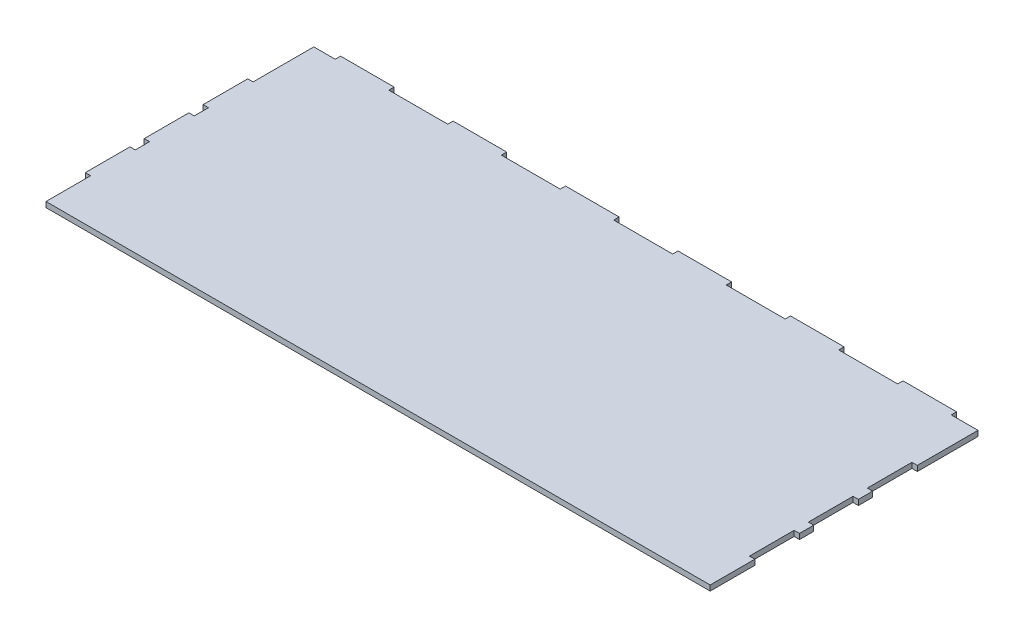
ISO-10303-21;
HEADER;
FILE_DESCRIPTION(('STEP AP214'),'2;1');
FILE_NAME('part.step','',(''),(''),'','','');
FILE_SCHEMA(('AUTOMOTIVE_DESIGN { 1 0 10303 214 1 1 1 1 }'));
ENDSEC;
DATA;
#1=APPLICATION_CONTEXT('core data for automotive mechanical design processes');
#2=APPLICATION_PROTOCOL_DEFINITION('international standard','automotive_design',2000,#1);
#3=PRODUCT_CONTEXT('',#1,'mechanical');
#4=PRODUCT('Part','Part','',(#3));
#5=PRODUCT_RELATED_PRODUCT_CATEGORY('part','',(#4));
#6=PRODUCT_DEFINITION_FORMATION('','',#4);
#7=PRODUCT_DEFINITION_CONTEXT('part definition',#1,'design');
#8=PRODUCT_DEFINITION('design','',#6,#7);
#9=PRODUCT_DEFINITION_SHAPE('','',#8);
#10=(LENGTH_UNIT() NAMED_UNIT(*) SI_UNIT(.MILLI.,.METRE.));
#11=(NAMED_UNIT(*) PLANE_ANGLE_UNIT() SI_UNIT($,.RADIAN.));
#12=(NAMED_UNIT(*) SI_UNIT($,.STERADIAN.) SOLID_ANGLE_UNIT());
#13=UNCERTAINTY_MEASURE_WITH_UNIT(LENGTH_MEASURE(1.E-05),#10,'distance_accuracy_value','');
#14=(GEOMETRIC_REPRESENTATION_CONTEXT(3) GLOBAL_UNCERTAINTY_ASSIGNED_CONTEXT((#13)) GLOBAL_UNIT_ASSIGNED_CONTEXT((#10,
#11,#12)) REPRESENTATION_CONTEXT('',''));
#15=CARTESIAN_POINT('',(0.,0.,0.));
#16=DIRECTION('',(0.,0.,1.));
#17=DIRECTION('',(1.,0.,0.));
#18=AXIS2_PLACEMENT_3D('',#15,#16,#17);
#19=CARTESIAN_POINT('',(0.,0.,0.));
#20=DIRECTION('',(0.,0.,-1.));
#21=DIRECTION('',(-1.,0.,0.));
#22=AXIS2_PLACEMENT_3D('',#19,#20,#21);
#23=PLANE('',#22);
#24=DIRECTION('',(1.,0.,0.));
#25=VECTOR('',#24,1.);
#26=CARTESIAN_POINT('',(125.,123.,0.));
#27=LINE('',#26,#25);
#28=CARTESIAN_POINT('',(-94.9999999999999,123.,0.));
#29=VERTEX_POINT('',#28);
#30=CARTESIAN_POINT('',(-73.,123.,0.));
#31=VERTEX_POINT('',#30);
#32=EDGE_CURVE('E679',#29,#31,#27,.T.);
#33=ORIENTED_EDGE('',*,*,#32,.F.);
#34=DIRECTION('',(0.,-1.,0.));
#35=VECTOR('',#34,1.);
#36=CARTESIAN_POINT('',(-95.,125.,0.));
#37=LINE('',#36,#35);
#38=CARTESIAN_POINT('',(-95.,125.,0.));
#39=VERTEX_POINT('',#38);
#40=EDGE_CURVE('E48',#39,#29,#37,.T.);
#41=ORIENTED_EDGE('',*,*,#40,.F.);
#42=DIRECTION('',(-1.,0.,0.));
#43=VECTOR('',#42,1.);
#44=CARTESIAN_POINT('',(125.,125.,0.));
#45=LINE('',#44,#43);
#46=CARTESIAN_POINT('',(-73.,125.,0.));
#47=VERTEX_POINT('',#46);
#48=EDGE_CURVE('E1303',#47,#39,#45,.T.);
#49=ORIENTED_EDGE('',*,*,#48,.F.);
#50=DIRECTION('',(0.,1.,0.));
#51=VECTOR('',#50,1.);
#52=CARTESIAN_POINT('',(-73.,125.,0.));
#53=LINE('',#52,#51);
#54=EDGE_CURVE('E385',#31,#47,#53,.T.);
#55=ORIENTED_EDGE('',*,*,#54,.F.);
#56=EDGE_LOOP('',(#33,#41,#49,#55));
#57=FACE_BOUND('',#56,.T.);
#58=ADVANCED_FACE('F32',(#57),#23,.T.);
#59=CARTESIAN_POINT('',(-115.,125.,0.));
#60=VERTEX_POINT('',#59);
#61=CARTESIAN_POINT('',(-123.,125.,0.));
#62=VERTEX_POINT('',#61);
#63=EDGE_CURVE('E669',#60,#62,#45,.T.);
#64=ORIENTED_EDGE('',*,*,#63,.F.);
#65=DIRECTION('',(0.,1.,0.));
#66=VECTOR('',#65,1.);
#67=CARTESIAN_POINT('',(-115.,125.,0.));
#68=LINE('',#67,#66);
#69=CARTESIAN_POINT('',(-115.,123.,0.));
#70=VERTEX_POINT('',#69);
#71=EDGE_CURVE('E381',#70,#60,#68,.T.);
#72=ORIENTED_EDGE('',*,*,#71,.F.);
#73=CARTESIAN_POINT('',(-123.,123.,0.));
#74=VERTEX_POINT('',#73);
#75=EDGE_CURVE('E660',#74,#70,#27,.T.);
#76=ORIENTED_EDGE('',*,*,#75,.F.);
#77=DIRECTION('',(0.,-1.,0.));
#78=VECTOR('',#77,1.);
#79=CARTESIAN_POINT('',(-123.,125.,0.));
#80=LINE('',#79,#78);
#81=EDGE_CURVE('E673',#62,#74,#80,.T.);
#82=ORIENTED_EDGE('',*,*,#81,.F.);
#83=EDGE_LOOP('',(#64,#72,#76,#82));
#84=FACE_BOUND('',#83,.T.);
#85=ADVANCED_FACE('F733',(#84),#23,.T.);
#86=CARTESIAN_POINT('',(-53.,123.,0.));
#87=VERTEX_POINT('',#86);
#88=CARTESIAN_POINT('',(-30.9999999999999,123.,0.));
#89=VERTEX_POINT('',#88);
#90=EDGE_CURVE('E1285',#87,#89,#27,.T.);
#91=ORIENTED_EDGE('',*,*,#90,.F.);
#92=DIRECTION('',(0.,-1.,0.));
#93=VECTOR('',#92,1.);
#94=CARTESIAN_POINT('',(-53.,125.,0.));
#95=LINE('',#94,#93);
#96=CARTESIAN_POINT('',(-53.,125.,0.));
#97=VERTEX_POINT('',#96);
#98=EDGE_CURVE('E56',#97,#87,#95,.T.);
#99=ORIENTED_EDGE('',*,*,#98,.F.);
#100=CARTESIAN_POINT('',(-30.9999999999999,125.,0.));
#101=VERTEX_POINT('',#100);
#102=EDGE_CURVE('E1301',#101,#97,#45,.T.);
#103=ORIENTED_EDGE('',*,*,#102,.F.);
#104=DIRECTION('',(0.,1.,0.));
#105=VECTOR('',#104,1.);
#106=CARTESIAN_POINT('',(-30.9999999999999,125.,0.));
#107=LINE('',#106,#105);
#108=EDGE_CURVE('E416',#89,#101,#107,.T.);
#109=ORIENTED_EDGE('',*,*,#108,.F.);
#110=EDGE_LOOP('',(#91,#99,#103,#109));
#111=FACE_BOUND('',#110,.T.);
#112=ADVANCED_FACE('F760',(#111),#23,.T.);
#113=CARTESIAN_POINT('',(-11.,123.,0.));
#114=VERTEX_POINT('',#113);
#115=CARTESIAN_POINT('',(11.0000000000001,123.,0.));
#116=VERTEX_POINT('',#115);
#117=EDGE_CURVE('E782',#114,#116,#27,.T.);
#118=ORIENTED_EDGE('',*,*,#117,.F.);
#119=DIRECTION('',(0.,-1.,0.));
#120=VECTOR('',#119,1.);
#121=CARTESIAN_POINT('',(-10.9999999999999,125.,0.));
#122=LINE('',#121,#120);
#123=CARTESIAN_POINT('',(-10.9999999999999,125.,0.));
#124=VERTEX_POINT('',#123);
#125=EDGE_CURVE('E411',#124,#114,#122,.T.);
#126=ORIENTED_EDGE('',*,*,#125,.F.);
#127=CARTESIAN_POINT('',(11.0000000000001,125.,0.));
#128=VERTEX_POINT('',#127);
#129=EDGE_CURVE('E1298',#128,#124,#45,.T.);
#130=ORIENTED_EDGE('',*,*,#129,.F.);
#131=DIRECTION('',(0.,1.,0.));
#132=VECTOR('',#131,1.);
#133=CARTESIAN_POINT('',(11.0000000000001,125.,0.));
#134=LINE('',#133,#132);
#135=EDGE_CURVE('E440',#116,#128,#134,.T.);
#136=ORIENTED_EDGE('',*,*,#135,.F.);
#137=EDGE_LOOP('',(#118,#126,#130,#136));
#138=FACE_BOUND('',#137,.T.);
#139=ADVANCED_FACE('F773',(#138),#23,.T.);
#140=CARTESIAN_POINT('',(31.0000000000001,123.,0.));
#141=VERTEX_POINT('',#140);
#142=CARTESIAN_POINT('',(53.0000000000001,123.,0.));
#143=VERTEX_POINT('',#142);
#144=EDGE_CURVE('E781',#141,#143,#27,.T.);
#145=ORIENTED_EDGE('',*,*,#144,.F.);
#146=DIRECTION('',(0.,-1.,0.));
#147=VECTOR('',#146,1.);
#148=CARTESIAN_POINT('',(31.0000000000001,125.,0.));
#149=LINE('',#148,#147);
#150=CARTESIAN_POINT('',(31.0000000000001,125.,0.));
#151=VERTEX_POINT('',#150);
#152=EDGE_CURVE('E435',#151,#141,#149,.T.);
#153=ORIENTED_EDGE('',*,*,#152,.F.);
#154=CARTESIAN_POINT('',(53.,125.,0.));
#155=VERTEX_POINT('',#154);
#156=EDGE_CURVE('E1300',#155,#151,#45,.T.);
#157=ORIENTED_EDGE('',*,*,#156,.F.);
#158=DIRECTION('',(0.,1.,0.));
#159=VECTOR('',#158,1.);
#160=CARTESIAN_POINT('',(53.0000000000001,125.,0.));
#161=LINE('',#160,#159);
#162=EDGE_CURVE('E464',#143,#155,#161,.T.);
#163=ORIENTED_EDGE('',*,*,#162,.F.);
#164=EDGE_LOOP('',(#145,#153,#157,#163));
#165=FACE_BOUND('',#164,.T.);
#166=ADVANCED_FACE('F765',(#165),#23,.T.);
#167=CARTESIAN_POINT('',(73.0000000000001,123.,0.));
#168=VERTEX_POINT('',#167);
#169=CARTESIAN_POINT('',(95.0000000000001,123.,0.));
#170=VERTEX_POINT('',#169);
#171=EDGE_CURVE('E778',#168,#170,#27,.T.);
#172=ORIENTED_EDGE('',*,*,#171,.F.);
#173=DIRECTION('',(0.,-1.,0.));
#174=VECTOR('',#173,1.);
#175=CARTESIAN_POINT('',(73.0000000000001,125.,0.));
#176=LINE('',#175,#174);
#177=CARTESIAN_POINT('',(73.0000000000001,125.,0.));
#178=VERTEX_POINT('',#177);
#179=EDGE_CURVE('E459',#178,#168,#176,.T.);
#180=ORIENTED_EDGE('',*,*,#179,.F.);
#181=CARTESIAN_POINT('',(95.0000000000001,125.,0.));
#182=VERTEX_POINT('',#181);
#183=EDGE_CURVE('E674',#182,#178,#45,.T.);
#184=ORIENTED_EDGE('',*,*,#183,.F.);
#185=DIRECTION('',(0.,1.,0.));
#186=VECTOR('',#185,1.);
#187=CARTESIAN_POINT('',(95.0000000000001,125.,0.));
#188=LINE('',#187,#186);
#189=EDGE_CURVE('E488',#170,#182,#188,.T.);
#190=ORIENTED_EDGE('',*,*,#189,.F.);
#191=EDGE_LOOP('',(#172,#180,#184,#190));
#192=FACE_BOUND('',#191,.T.);
#193=ADVANCED_FACE('F756',(#192),#23,.T.);
#194=DIRECTION('',(0.,-1.,0.));
#195=VECTOR('',#194,1.);
#196=CARTESIAN_POINT('',(115.,125.,0.));
#197=LINE('',#196,#195);
#198=CARTESIAN_POINT('',(115.,125.,0.));
#199=VERTEX_POINT('',#198);
#200=CARTESIAN_POINT('',(115.,123.,0.));
#201=VERTEX_POINT('',#200);
#202=EDGE_CURVE('E483',#199,#201,#197,.T.);
#203=ORIENTED_EDGE('',*,*,#202,.F.);
#204=CARTESIAN_POINT('',(125.,125.,0.));
#205=VERTEX_POINT('',#204);
#206=EDGE_CURVE('E670',#205,#199,#45,.T.);
#207=ORIENTED_EDGE('',*,*,#206,.F.);
#208=DIRECTION('',(0.,1.,0.));
#209=VECTOR('',#208,1.);
#210=CARTESIAN_POINT('',(125.,125.,0.));
#211=LINE('',#210,#209);
#212=CARTESIAN_POINT('',(125.,123.,0.));
#213=VERTEX_POINT('',#212);
#214=EDGE_CURVE('E655',#213,#205,#211,.T.);
#215=ORIENTED_EDGE('',*,*,#214,.F.);
#216=EDGE_CURVE('E677',#201,#213,#27,.T.);
#217=ORIENTED_EDGE('',*,*,#216,.F.);
#218=EDGE_LOOP('',(#203,#207,#215,#217));
#219=FACE_BOUND('',#218,.T.);
#220=ADVANCED_FACE('F764',(#219),#23,.T.);
#221=CARTESIAN_POINT('',(125.,125.,100.));
#222=DIRECTION('',(-1.,0.,0.));
#223=DIRECTION('',(0.,0.,1.));
#224=AXIS2_PLACEMENT_3D('',#221,#222,#223);
#225=PLANE('',#224);
#226=DIRECTION('',(0.,0.,-1.));
#227=VECTOR('',#226,1.);
#228=CARTESIAN_POINT('',(125.,125.,100.));
#229=LINE('',#228,#227);
#230=CARTESIAN_POINT('',(125.,125.000000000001,22.6666666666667));
#231=VERTEX_POINT('',#230);
#232=EDGE_CURVE('E41',#231,#205,#229,.T.);
#233=ORIENTED_EDGE('',*,*,#232,.F.);
#234=DIRECTION('',(0.,1.,0.));
#235=VECTOR('',#234,1.);
#236=CARTESIAN_POINT('',(125.,125.000000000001,22.6666666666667));
#237=LINE('',#236,#235);
#238=CARTESIAN_POINT('',(125.,123.,22.6666666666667));
#239=VERTEX_POINT('',#238);
#240=EDGE_CURVE('E515',#239,#231,#237,.T.);
#241=ORIENTED_EDGE('',*,*,#240,.F.);
#242=DIRECTION('',(0.,0.,-1.));
#243=VECTOR('',#242,1.);
#244=CARTESIAN_POINT('',(125.,123.,100.));
#245=LINE('',#244,#243);
#246=EDGE_CURVE('E666',#239,#213,#245,.T.);
#247=ORIENTED_EDGE('',*,*,#246,.T.);
#248=ORIENTED_EDGE('',*,*,#214,.T.);
#249=EDGE_LOOP('',(#233,#241,#247,#248));
#250=FACE_BOUND('',#249,.T.);
#251=ADVANCED_FACE('F771',(#250),#225,.F.);
#252=CARTESIAN_POINT('',(125.,123.,44.6666666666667));
#253=VERTEX_POINT('',#252);
#254=CARTESIAN_POINT('',(125.,123.,39.3333333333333));
#255=VERTEX_POINT('',#254);
#256=EDGE_CURVE('E790',#253,#255,#245,.T.);
#257=ORIENTED_EDGE('',*,*,#256,.T.);
#258=DIRECTION('',(0.,-1.,0.));
#259=VECTOR('',#258,1.);
#260=CARTESIAN_POINT('',(125.,123.,39.3333333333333));
#261=LINE('',#260,#259);
#262=CARTESIAN_POINT('',(125.,125.000000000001,39.3333333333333));
#263=VERTEX_POINT('',#262);
#264=EDGE_CURVE('E523',#263,#255,#261,.T.);
#265=ORIENTED_EDGE('',*,*,#264,.F.);
#266=CARTESIAN_POINT('',(125.,125.000000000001,44.6666666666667));
#267=VERTEX_POINT('',#266);
#268=EDGE_CURVE('E694',#267,#263,#229,.T.);
#269=ORIENTED_EDGE('',*,*,#268,.F.);
#270=DIRECTION('',(0.,1.,0.));
#271=VECTOR('',#270,1.);
#272=CARTESIAN_POINT('',(125.,125.000000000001,44.6666666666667));
#273=LINE('',#272,#271);
#274=EDGE_CURVE('E541',#253,#267,#273,.T.);
#275=ORIENTED_EDGE('',*,*,#274,.F.);
#276=EDGE_LOOP('',(#257,#265,#269,#275));
#277=FACE_BOUND('',#276,.T.);
#278=ADVANCED_FACE('F923',(#277),#225,.F.);
#279=CARTESIAN_POINT('',(125.,123.,66.6666666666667));
#280=VERTEX_POINT('',#279);
#281=CARTESIAN_POINT('',(125.,123.,61.3333333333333));
#282=VERTEX_POINT('',#281);
#283=EDGE_CURVE('E684',#280,#282,#245,.T.);
#284=ORIENTED_EDGE('',*,*,#283,.T.);
#285=DIRECTION('',(0.,-1.,0.));
#286=VECTOR('',#285,1.);
#287=CARTESIAN_POINT('',(125.,123.,61.3333333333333));
#288=LINE('',#287,#286);
#289=CARTESIAN_POINT('',(125.,125.000000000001,61.3333333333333));
#290=VERTEX_POINT('',#289);
#291=EDGE_CURVE('E549',#290,#282,#288,.T.);
#292=ORIENTED_EDGE('',*,*,#291,.F.);
#293=CARTESIAN_POINT('',(125.,125.000000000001,66.6666666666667));
#294=VERTEX_POINT('',#293);
#295=EDGE_CURVE('E40',#294,#290,#229,.T.);
#296=ORIENTED_EDGE('',*,*,#295,.F.);
#297=DIRECTION('',(0.,1.,0.));
#298=VECTOR('',#297,1.);
#299=CARTESIAN_POINT('',(125.,125.000000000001,66.6666666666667));
#300=LINE('',#299,#298);
#301=EDGE_CURVE('E565',#280,#294,#300,.T.);
#302=ORIENTED_EDGE('',*,*,#301,.F.);
#303=EDGE_LOOP('',(#284,#292,#296,#302));
#304=FACE_BOUND('',#303,.T.);
#305=ADVANCED_FACE('F913',(#304),#225,.F.);
#306=CARTESIAN_POINT('',(-123.,125.,100.));
#307=DIRECTION('',(1.,0.,0.));
#308=DIRECTION('',(0.,1.,0.));
#309=AXIS2_PLACEMENT_3D('',#306,#307,#308);
#310=PLANE('',#309);
#311=DIRECTION('',(0.,1.,0.));
#312=VECTOR('',#311,1.);
#313=CARTESIAN_POINT('',(-123.000000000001,123.,39.3333333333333));
#314=LINE('',#313,#312);
#315=CARTESIAN_POINT('',(-123.000000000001,123.,39.3333333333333));
#316=VERTEX_POINT('',#315);
#317=CARTESIAN_POINT('',(-123.000000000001,125.000000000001,39.3333333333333));
#318=VERTEX_POINT('',#317);
#319=EDGE_CURVE('E530',#316,#318,#314,.T.);
#320=ORIENTED_EDGE('',*,*,#319,.F.);
#321=DIRECTION('',(0.,0.,-1.));
#322=VECTOR('',#321,1.);
#323=CARTESIAN_POINT('',(-123.,123.,100.));
#324=LINE('',#323,#322);
#325=CARTESIAN_POINT('',(-123.,123.,44.6666666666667));
#326=VERTEX_POINT('',#325);
#327=EDGE_CURVE('E722',#326,#316,#324,.T.);
#328=ORIENTED_EDGE('',*,*,#327,.F.);
#329=DIRECTION('',(0.,-1.,0.));
#330=VECTOR('',#329,1.);
#331=CARTESIAN_POINT('',(-123.000000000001,123.,44.6666666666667));
#332=LINE('',#331,#330);
#333=CARTESIAN_POINT('',(-123.000000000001,125.000000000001,44.6666666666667));
#334=VERTEX_POINT('',#333);
#335=EDGE_CURVE('E610',#334,#326,#332,.T.);
#336=ORIENTED_EDGE('',*,*,#335,.F.);
#337=DIRECTION('',(0.,0.,-1.));
#338=VECTOR('',#337,1.);
#339=CARTESIAN_POINT('',(-123.,125.,100.));
#340=LINE('',#339,#338);
#341=EDGE_CURVE('E696',#334,#318,#340,.T.);
#342=ORIENTED_EDGE('',*,*,#341,.T.);
#343=EDGE_LOOP('',(#320,#328,#336,#342));
#344=FACE_BOUND('',#343,.T.);
#345=ADVANCED_FACE('F707',(#344),#310,.F.);
#346=DIRECTION('',(0.,-1.,0.));
#347=VECTOR('',#346,1.);
#348=CARTESIAN_POINT('',(-123.000000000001,123.,22.6666666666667));
#349=LINE('',#348,#347);
#350=CARTESIAN_POINT('',(-123.000000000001,125.000000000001,22.6666666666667));
#351=VERTEX_POINT('',#350);
#352=CARTESIAN_POINT('',(-123.,123.,22.6666666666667));
#353=VERTEX_POINT('',#352);
#354=EDGE_CURVE('E587',#351,#353,#349,.T.);
#355=ORIENTED_EDGE('',*,*,#354,.F.);
#356=EDGE_CURVE('E687',#351,#62,#340,.T.);
#357=ORIENTED_EDGE('',*,*,#356,.T.);
#358=ORIENTED_EDGE('',*,*,#81,.T.);
#359=EDGE_CURVE('E683',#353,#74,#324,.T.);
#360=ORIENTED_EDGE('',*,*,#359,.F.);
#361=EDGE_LOOP('',(#355,#357,#358,#360));
#362=FACE_BOUND('',#361,.T.);
#363=ADVANCED_FACE('F729',(#362),#310,.F.);
#364=DIRECTION('',(0.,1.,0.));
#365=VECTOR('',#364,1.);
#366=CARTESIAN_POINT('',(-123.000000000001,123.,61.3333333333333));
#367=LINE('',#366,#365);
#368=CARTESIAN_POINT('',(-123.000000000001,123.,61.3333333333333));
#369=VERTEX_POINT('',#368);
#370=CARTESIAN_POINT('',(-123.000000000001,125.000000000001,61.3333333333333));
#371=VERTEX_POINT('',#370);
#372=EDGE_CURVE('E605',#369,#371,#367,.T.);
#373=ORIENTED_EDGE('',*,*,#372,.F.);
#374=CARTESIAN_POINT('',(-123.000000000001,123.,66.6666666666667));
#375=VERTEX_POINT('',#374);
#376=EDGE_CURVE('E688',#375,#369,#324,.T.);
#377=ORIENTED_EDGE('',*,*,#376,.F.);
#378=DIRECTION('',(0.,-1.,0.));
#379=VECTOR('',#378,1.);
#380=CARTESIAN_POINT('',(-123.000000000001,123.,66.6666666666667));
#381=LINE('',#380,#379);
#382=CARTESIAN_POINT('',(-123.,125.,66.6666666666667));
#383=VERTEX_POINT('',#382);
#384=EDGE_CURVE('E633',#383,#375,#381,.T.);
#385=ORIENTED_EDGE('',*,*,#384,.F.);
#386=EDGE_CURVE('E690',#383,#371,#340,.T.);
#387=ORIENTED_EDGE('',*,*,#386,.T.);
#388=EDGE_LOOP('',(#373,#377,#385,#387));
#389=FACE_BOUND('',#388,.T.);
#390=ADVANCED_FACE('F944',(#389),#310,.F.);
#391=DIRECTION('',(0.,1.,0.));
#392=VECTOR('',#391,1.);
#393=CARTESIAN_POINT('',(-123.000000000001,123.,83.3333333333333));
#394=LINE('',#393,#392);
#395=CARTESIAN_POINT('',(-123.,123.,83.3333333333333));
#396=VERTEX_POINT('',#395);
#397=CARTESIAN_POINT('',(-123.,125.,83.3333333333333));
#398=VERTEX_POINT('',#397);
#399=EDGE_CURVE('E628',#396,#398,#394,.T.);
#400=ORIENTED_EDGE('',*,*,#399,.F.);
#401=CARTESIAN_POINT('',(-123.,123.,100.));
#402=VERTEX_POINT('',#401);
#403=EDGE_CURVE('E685',#402,#396,#324,.T.);
#404=ORIENTED_EDGE('',*,*,#403,.F.);
#405=DIRECTION('',(0.,-1.,0.));
#406=VECTOR('',#405,1.);
#407=CARTESIAN_POINT('',(-123.,125.,100.));
#408=LINE('',#407,#406);
#409=CARTESIAN_POINT('',(-123.,125.,100.));
#410=VERTEX_POINT('',#409);
#411=EDGE_CURVE('E662',#410,#402,#408,.T.);
#412=ORIENTED_EDGE('',*,*,#411,.F.);
#413=EDGE_CURVE('E689',#410,#398,#340,.T.);
#414=ORIENTED_EDGE('',*,*,#413,.T.);
#415=EDGE_LOOP('',(#400,#404,#412,#414));
#416=FACE_BOUND('',#415,.T.);
#417=ADVANCED_FACE('F900',(#416),#310,.F.);
#418=CARTESIAN_POINT('',(125.,123.,100.));
#419=VERTEX_POINT('',#418);
#420=CARTESIAN_POINT('',(125.,123.,83.3333333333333));
#421=VERTEX_POINT('',#420);
#422=EDGE_CURVE('E680',#419,#421,#245,.T.);
#423=ORIENTED_EDGE('',*,*,#422,.T.);
#424=DIRECTION('',(0.,-1.,0.));
#425=VECTOR('',#424,1.);
#426=CARTESIAN_POINT('',(125.,123.,83.3333333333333));
#427=LINE('',#426,#425);
#428=CARTESIAN_POINT('',(125.,125.000000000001,83.3333333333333));
#429=VERTEX_POINT('',#428);
#430=EDGE_CURVE('E510',#429,#421,#427,.T.);
#431=ORIENTED_EDGE('',*,*,#430,.F.);
#432=CARTESIAN_POINT('',(125.,125.,100.));
#433=VERTEX_POINT('',#432);
#434=EDGE_CURVE('E11',#433,#429,#229,.T.);
#435=ORIENTED_EDGE('',*,*,#434,.F.);
#436=DIRECTION('',(0.,1.,0.));
#437=VECTOR('',#436,1.);
#438=CARTESIAN_POINT('',(125.,125.,100.));
#439=LINE('',#438,#437);
#440=EDGE_CURVE('E656',#419,#433,#439,.T.);
#441=ORIENTED_EDGE('',*,*,#440,.F.);
#442=EDGE_LOOP('',(#423,#431,#435,#441));
#443=FACE_BOUND('',#442,.T.);
#444=ADVANCED_FACE('F34',(#443),#225,.F.);
#445=CARTESIAN_POINT('',(125.,125.,100.));
#446=DIRECTION('',(0.,-1.,0.));
#447=DIRECTION('',(1.,0.,0.));
#448=AXIS2_PLACEMENT_3D('',#445,#446,#447);
#449=PLANE('',#448);
#450=DIRECTION('',(0.,0.,1.));
#451=VECTOR('',#450,1.);
#452=CARTESIAN_POINT('',(123.,125.000000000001,39.3333333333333));
#453=LINE('',#452,#451);
#454=CARTESIAN_POINT('',(123.,125.000000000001,22.6666666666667));
#455=VERTEX_POINT('',#454);
#456=CARTESIAN_POINT('',(123.,125.000000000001,39.3333333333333));
#457=VERTEX_POINT('',#456);
#458=EDGE_CURVE('E511',#455,#457,#453,.T.);
#459=ORIENTED_EDGE('',*,*,#458,.F.);
#460=DIRECTION('',(1.,0.,0.));
#461=VECTOR('',#460,1.);
#462=CARTESIAN_POINT('',(123.,125.000000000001,22.6666666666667));
#463=LINE('',#462,#461);
#464=EDGE_CURVE('E527',#455,#231,#463,.T.);
#465=ORIENTED_EDGE('',*,*,#464,.T.);
#466=ORIENTED_EDGE('',*,*,#232,.T.);
#467=ORIENTED_EDGE('',*,*,#206,.T.);
#468=DIRECTION('',(0.,0.,1.));
#469=VECTOR('',#468,1.);
#470=CARTESIAN_POINT('',(115.,125.,-2.));
#471=LINE('',#470,#469);
#472=CARTESIAN_POINT('',(115.,125.,-2.));
#473=VERTEX_POINT('',#472);
#474=EDGE_CURVE('E494',#473,#199,#471,.T.);
#475=ORIENTED_EDGE('',*,*,#474,.F.);
#476=DIRECTION('',(1.,0.,0.));
#477=VECTOR('',#476,1.);
#478=CARTESIAN_POINT('',(115.,125.,-2.));
#479=LINE('',#478,#477);
#480=CARTESIAN_POINT('',(95.0000000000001,125.,-2.));
#481=VERTEX_POINT('',#480);
#482=EDGE_CURVE('E492',#481,#473,#479,.T.);
#483=ORIENTED_EDGE('',*,*,#482,.F.);
#484=DIRECTION('',(0.,0.,1.));
#485=VECTOR('',#484,1.);
#486=CARTESIAN_POINT('',(95.0000000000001,125.,-2.));
#487=LINE('',#486,#485);
#488=EDGE_CURVE('E501',#481,#182,#487,.T.);
#489=ORIENTED_EDGE('',*,*,#488,.T.);
#490=ORIENTED_EDGE('',*,*,#183,.T.);
#491=DIRECTION('',(0.,0.,1.));
#492=VECTOR('',#491,1.);
#493=CARTESIAN_POINT('',(73.0000000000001,125.,-2.));
#494=LINE('',#493,#492);
#495=CARTESIAN_POINT('',(73.0000000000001,125.,-2.));
#496=VERTEX_POINT('',#495);
#497=EDGE_CURVE('E470',#496,#178,#494,.T.);
#498=ORIENTED_EDGE('',*,*,#497,.F.);
#499=DIRECTION('',(1.,0.,0.));
#500=VECTOR('',#499,1.);
#501=CARTESIAN_POINT('',(73.0000000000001,125.,-2.));
#502=LINE('',#501,#500);
#503=CARTESIAN_POINT('',(53.0000000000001,125.,-2.));
#504=VERTEX_POINT('',#503);
#505=EDGE_CURVE('E468',#504,#496,#502,.T.);
#506=ORIENTED_EDGE('',*,*,#505,.F.);
#507=DIRECTION('',(0.,0.,1.));
#508=VECTOR('',#507,1.);
#509=CARTESIAN_POINT('',(53.0000000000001,125.,-2.));
#510=LINE('',#509,#508);
#511=EDGE_CURVE('E476',#504,#155,#510,.T.);
#512=ORIENTED_EDGE('',*,*,#511,.T.);
#513=ORIENTED_EDGE('',*,*,#156,.T.);
#514=DIRECTION('',(0.,0.,1.));
#515=VECTOR('',#514,1.);
#516=CARTESIAN_POINT('',(31.0000000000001,125.,-2.));
#517=LINE('',#516,#515);
#518=CARTESIAN_POINT('',(31.0000000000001,125.,-2.));
#519=VERTEX_POINT('',#518);
#520=EDGE_CURVE('E446',#519,#151,#517,.T.);
#521=ORIENTED_EDGE('',*,*,#520,.F.);
#522=DIRECTION('',(1.,0.,0.));
#523=VECTOR('',#522,1.);
#524=CARTESIAN_POINT('',(31.0000000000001,125.,-2.));
#525=LINE('',#524,#523);
#526=CARTESIAN_POINT('',(11.0000000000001,125.,-2.));
#527=VERTEX_POINT('',#526);
#528=EDGE_CURVE('E444',#527,#519,#525,.T.);
#529=ORIENTED_EDGE('',*,*,#528,.F.);
#530=DIRECTION('',(0.,0.,1.));
#531=VECTOR('',#530,1.);
#532=CARTESIAN_POINT('',(11.0000000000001,125.,-2.));
#533=LINE('',#532,#531);
#534=EDGE_CURVE('E450',#527,#128,#533,.T.);
#535=ORIENTED_EDGE('',*,*,#534,.T.);
#536=ORIENTED_EDGE('',*,*,#129,.T.);
#537=DIRECTION('',(0.,0.,1.));
#538=VECTOR('',#537,1.);
#539=CARTESIAN_POINT('',(-10.9999999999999,125.,-2.));
#540=LINE('',#539,#538);
#541=CARTESIAN_POINT('',(-10.9999999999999,125.,-2.));
#542=VERTEX_POINT('',#541);
#543=EDGE_CURVE('E422',#542,#124,#540,.T.);
#544=ORIENTED_EDGE('',*,*,#543,.F.);
#545=DIRECTION('',(1.,0.,0.));
#546=VECTOR('',#545,1.);
#547=CARTESIAN_POINT('',(-10.9999999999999,125.,-2.));
#548=LINE('',#547,#546);
#549=CARTESIAN_POINT('',(-30.9999999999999,125.,-2.));
#550=VERTEX_POINT('',#549);
#551=EDGE_CURVE('E420',#550,#542,#548,.T.);
#552=ORIENTED_EDGE('',*,*,#551,.F.);
#553=DIRECTION('',(0.,0.,1.));
#554=VECTOR('',#553,1.);
#555=CARTESIAN_POINT('',(-30.9999999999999,125.,-2.));
#556=LINE('',#555,#554);
#557=EDGE_CURVE('E426',#550,#101,#556,.T.);
#558=ORIENTED_EDGE('',*,*,#557,.T.);
#559=ORIENTED_EDGE('',*,*,#102,.T.);
#560=DIRECTION('',(0.,0.,1.));
#561=VECTOR('',#560,1.);
#562=CARTESIAN_POINT('',(-53.,125.,-2.));
#563=LINE('',#562,#561);
#564=CARTESIAN_POINT('',(-53.,125.,-2.));
#565=VERTEX_POINT('',#564);
#566=EDGE_CURVE('E399',#565,#97,#563,.T.);
#567=ORIENTED_EDGE('',*,*,#566,.F.);
#568=DIRECTION('',(1.,0.,0.));
#569=VECTOR('',#568,1.);
#570=CARTESIAN_POINT('',(-53.,125.,-2.));
#571=LINE('',#570,#569);
#572=CARTESIAN_POINT('',(-73.,125.,-2.));
#573=VERTEX_POINT('',#572);
#574=EDGE_CURVE('E398',#573,#565,#571,.T.);
#575=ORIENTED_EDGE('',*,*,#574,.F.);
#576=DIRECTION('',(0.,0.,1.));
#577=VECTOR('',#576,1.);
#578=CARTESIAN_POINT('',(-73.,125.,-2.));
#579=LINE('',#578,#577);
#580=EDGE_CURVE('E403',#573,#47,#579,.T.);
#581=ORIENTED_EDGE('',*,*,#580,.T.);
#582=ORIENTED_EDGE('',*,*,#48,.T.);
#583=DIRECTION('',(0.,0.,1.));
#584=VECTOR('',#583,1.);
#585=CARTESIAN_POINT('',(-95.,125.,-2.));
#586=LINE('',#585,#584);
#587=CARTESIAN_POINT('',(-95.,125.,-2.));
#588=VERTEX_POINT('',#587);
#589=EDGE_CURVE('E741',#588,#39,#586,.T.);
#590=ORIENTED_EDGE('',*,*,#589,.F.);
#591=DIRECTION('',(1.,0.,0.));
#592=VECTOR('',#591,1.);
#593=CARTESIAN_POINT('',(-95.,125.,-2.));
#594=LINE('',#593,#592);
#595=CARTESIAN_POINT('',(-115.,125.,-2.));
#596=VERTEX_POINT('',#595);
#597=EDGE_CURVE('E379',#596,#588,#594,.T.);
#598=ORIENTED_EDGE('',*,*,#597,.F.);
#599=DIRECTION('',(0.,0.,1.));
#600=VECTOR('',#599,1.);
#601=CARTESIAN_POINT('',(-115.,125.,-2.));
#602=LINE('',#601,#600);
#603=EDGE_CURVE('E387',#596,#60,#602,.T.);
#604=ORIENTED_EDGE('',*,*,#603,.T.);
#605=ORIENTED_EDGE('',*,*,#63,.T.);
#606=ORIENTED_EDGE('',*,*,#356,.F.);
#607=DIRECTION('',(1.,0.,0.));
#608=VECTOR('',#607,1.);
#609=CARTESIAN_POINT('',(-125.000000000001,125.000000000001,22.6666666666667));
#610=LINE('',#609,#608);
#611=CARTESIAN_POINT('',(-125.000000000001,125.000000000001,22.6666666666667));
#612=VERTEX_POINT('',#611);
#613=EDGE_CURVE('E601',#612,#351,#610,.T.);
#614=ORIENTED_EDGE('',*,*,#613,.F.);
#615=DIRECTION('',(0.,0.,-1.));
#616=VECTOR('',#615,1.);
#617=CARTESIAN_POINT('',(-125.000000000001,125.000000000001,39.3333333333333));
#618=LINE('',#617,#616);
#619=CARTESIAN_POINT('',(-125.000000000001,125.000000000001,39.3333333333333));
#620=VERTEX_POINT('',#619);
#621=EDGE_CURVE('E586',#620,#612,#618,.T.);
#622=ORIENTED_EDGE('',*,*,#621,.F.);
#623=DIRECTION('',(1.,0.,0.));
#624=VECTOR('',#623,1.);
#625=CARTESIAN_POINT('',(-125.000000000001,125.000000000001,39.3333333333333));
#626=LINE('',#625,#624);
#627=EDGE_CURVE('E603',#620,#318,#626,.T.);
#628=ORIENTED_EDGE('',*,*,#627,.T.);
#629=ORIENTED_EDGE('',*,*,#341,.F.);
#630=DIRECTION('',(1.,0.,0.));
#631=VECTOR('',#630,1.);
#632=CARTESIAN_POINT('',(-125.000000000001,125.000000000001,44.6666666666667));
#633=LINE('',#632,#631);
#634=CARTESIAN_POINT('',(-125.000000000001,125.000000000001,44.6666666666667));
#635=VERTEX_POINT('',#634);
#636=EDGE_CURVE('E624',#635,#334,#633,.T.);
#637=ORIENTED_EDGE('',*,*,#636,.F.);
#638=DIRECTION('',(0.,0.,-1.));
#639=VECTOR('',#638,1.);
#640=CARTESIAN_POINT('',(-125.000000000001,125.000000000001,61.3333333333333));
#641=LINE('',#640,#639);
#642=CARTESIAN_POINT('',(-125.000000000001,125.000000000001,61.3333333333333));
#643=VERTEX_POINT('',#642);
#644=EDGE_CURVE('E609',#643,#635,#641,.T.);
#645=ORIENTED_EDGE('',*,*,#644,.F.);
#646=DIRECTION('',(1.,0.,0.));
#647=VECTOR('',#646,1.);
#648=CARTESIAN_POINT('',(-125.000000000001,125.000000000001,61.3333333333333));
#649=LINE('',#648,#647);
#650=EDGE_CURVE('E626',#643,#371,#649,.T.);
#651=ORIENTED_EDGE('',*,*,#650,.T.);
#652=ORIENTED_EDGE('',*,*,#386,.F.);
#653=DIRECTION('',(1.,0.,0.));
#654=VECTOR('',#653,1.);
#655=CARTESIAN_POINT('',(-125.000000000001,125.000000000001,66.6666666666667));
#656=LINE('',#655,#654);
#657=CARTESIAN_POINT('',(-125.000000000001,125.000000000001,66.6666666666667));
#658=VERTEX_POINT('',#657);
#659=EDGE_CURVE('E649',#658,#383,#656,.T.);
#660=ORIENTED_EDGE('',*,*,#659,.F.);
#661=DIRECTION('',(0.,0.,-1.));
#662=VECTOR('',#661,1.);
#663=CARTESIAN_POINT('',(-125.000000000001,125.000000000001,83.3333333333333));
#664=LINE('',#663,#662);
#665=CARTESIAN_POINT('',(-125.000000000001,125.000000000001,83.3333333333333));
#666=VERTEX_POINT('',#665);
#667=EDGE_CURVE('E632',#666,#658,#664,.T.);
#668=ORIENTED_EDGE('',*,*,#667,.F.);
#669=DIRECTION('',(1.,0.,0.));
#670=VECTOR('',#669,1.);
#671=CARTESIAN_POINT('',(-125.000000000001,125.000000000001,83.3333333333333));
#672=LINE('',#671,#670);
#673=EDGE_CURVE('E652',#666,#398,#672,.T.);
#674=ORIENTED_EDGE('',*,*,#673,.T.);
#675=ORIENTED_EDGE('',*,*,#413,.F.);
#676=DIRECTION('',(-1.,0.,0.));
#677=VECTOR('',#676,1.);
#678=CARTESIAN_POINT('',(125.,125.,100.));
#679=LINE('',#678,#677);
#680=EDGE_CURVE('E659',#433,#410,#679,.T.);
#681=ORIENTED_EDGE('',*,*,#680,.F.);
#682=ORIENTED_EDGE('',*,*,#434,.T.);
#683=DIRECTION('',(1.,0.,0.));
#684=VECTOR('',#683,1.);
#685=CARTESIAN_POINT('',(123.,125.000000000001,83.3333333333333));
#686=LINE('',#685,#684);
#687=CARTESIAN_POINT('',(123.,125.000000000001,83.3333333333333));
#688=VERTEX_POINT('',#687);
#689=EDGE_CURVE('E572',#688,#429,#686,.T.);
#690=ORIENTED_EDGE('',*,*,#689,.F.);
#691=DIRECTION('',(0.,0.,1.));
#692=VECTOR('',#691,1.);
#693=CARTESIAN_POINT('',(123.,125.000000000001,83.3333333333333));
#694=LINE('',#693,#692);
#695=CARTESIAN_POINT('',(123.,125.000000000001,66.6666666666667));
#696=VERTEX_POINT('',#695);
#697=EDGE_CURVE('E561',#696,#688,#694,.T.);
#698=ORIENTED_EDGE('',*,*,#697,.F.);
#699=DIRECTION('',(1.,0.,0.));
#700=VECTOR('',#699,1.);
#701=CARTESIAN_POINT('',(123.,125.000000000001,66.6666666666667));
#702=LINE('',#701,#700);
#703=EDGE_CURVE('E551',#696,#294,#702,.T.);
#704=ORIENTED_EDGE('',*,*,#703,.T.);
#705=ORIENTED_EDGE('',*,*,#295,.T.);
#706=DIRECTION('',(1.,0.,0.));
#707=VECTOR('',#706,1.);
#708=CARTESIAN_POINT('',(123.,125.000000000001,61.3333333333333));
#709=LINE('',#708,#707);
#710=CARTESIAN_POINT('',(123.,125.000000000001,61.3333333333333));
#711=VERTEX_POINT('',#710);
#712=EDGE_CURVE('E548',#711,#290,#709,.T.);
#713=ORIENTED_EDGE('',*,*,#712,.F.);
#714=DIRECTION('',(0.,0.,1.));
#715=VECTOR('',#714,1.);
#716=CARTESIAN_POINT('',(123.,125.000000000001,61.3333333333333));
#717=LINE('',#716,#715);
#718=CARTESIAN_POINT('',(123.,125.000000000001,44.6666666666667));
#719=VERTEX_POINT('',#718);
#720=EDGE_CURVE('E537',#719,#711,#717,.T.);
#721=ORIENTED_EDGE('',*,*,#720,.F.);
#722=DIRECTION('',(1.,0.,0.));
#723=VECTOR('',#722,1.);
#724=CARTESIAN_POINT('',(123.,125.000000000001,44.6666666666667));
#725=LINE('',#724,#723);
#726=EDGE_CURVE('E525',#719,#267,#725,.T.);
#727=ORIENTED_EDGE('',*,*,#726,.T.);
#728=ORIENTED_EDGE('',*,*,#268,.T.);
#729=DIRECTION('',(1.,0.,0.));
#730=VECTOR('',#729,1.);
#731=CARTESIAN_POINT('',(123.,125.000000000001,39.3333333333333));
#732=LINE('',#731,#730);
#733=EDGE_CURVE('E522',#457,#263,#732,.T.);
#734=ORIENTED_EDGE('',*,*,#733,.F.);
#735=EDGE_LOOP('',(#459,#465,#466,#467,#475,#483,#489,#490,#498,#506,#512,#513,#521,#529,#535,
#536,#544,#552,#558,#559,#567,#575,#581,#582,#590,#598,#604,#605,#606,#614,#622,#628,#629,#637,
#645,#651,#652,#660,#668,#674,#675,#681,#682,#690,#698,#704,#705,#713,#721,#727,#728,#734));
#736=FACE_BOUND('',#735,.T.);
#737=ADVANCED_FACE('F713',(#736),#449,.F.);
#738=CARTESIAN_POINT('',(125.,123.,100.));
#739=DIRECTION('',(0.,1.,0.));
#740=DIRECTION('',(-1.,0.,0.));
#741=AXIS2_PLACEMENT_3D('',#738,#739,#740);
#742=PLANE('',#741);
#743=ORIENTED_EDGE('',*,*,#246,.F.);
#744=DIRECTION('',(1.,0.,0.));
#745=VECTOR('',#744,1.);
#746=CARTESIAN_POINT('',(123.,123.,22.6666666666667));
#747=LINE('',#746,#745);
#748=CARTESIAN_POINT('',(123.,123.,22.6666666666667));
#749=VERTEX_POINT('',#748);
#750=EDGE_CURVE('E531',#749,#239,#747,.T.);
#751=ORIENTED_EDGE('',*,*,#750,.F.);
#752=DIRECTION('',(0.,0.,-1.));
#753=VECTOR('',#752,1.);
#754=CARTESIAN_POINT('',(123.,123.,22.6666666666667));
#755=LINE('',#754,#753);
#756=CARTESIAN_POINT('',(123.,123.,39.3333333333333));
#757=VERTEX_POINT('',#756);
#758=EDGE_CURVE('E517',#757,#749,#755,.T.);
#759=ORIENTED_EDGE('',*,*,#758,.F.);
#760=DIRECTION('',(1.,0.,0.));
#761=VECTOR('',#760,1.);
#762=CARTESIAN_POINT('',(123.,123.,39.3333333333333));
#763=LINE('',#762,#761);
#764=EDGE_CURVE('E533',#757,#255,#763,.T.);
#765=ORIENTED_EDGE('',*,*,#764,.T.);
#766=ORIENTED_EDGE('',*,*,#256,.F.);
#767=DIRECTION('',(1.,0.,0.));
#768=VECTOR('',#767,1.);
#769=CARTESIAN_POINT('',(123.,123.,44.6666666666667));
#770=LINE('',#769,#768);
#771=CARTESIAN_POINT('',(123.,123.,44.6666666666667));
#772=VERTEX_POINT('',#771);
#773=EDGE_CURVE('E555',#772,#253,#770,.T.);
#774=ORIENTED_EDGE('',*,*,#773,.F.);
#775=DIRECTION('',(0.,0.,-1.));
#776=VECTOR('',#775,1.);
#777=CARTESIAN_POINT('',(123.,123.,44.6666666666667));
#778=LINE('',#777,#776);
#779=CARTESIAN_POINT('',(123.,123.,61.3333333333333));
#780=VERTEX_POINT('',#779);
#781=EDGE_CURVE('E543',#780,#772,#778,.T.);
#782=ORIENTED_EDGE('',*,*,#781,.F.);
#783=DIRECTION('',(1.,0.,0.));
#784=VECTOR('',#783,1.);
#785=CARTESIAN_POINT('',(123.,123.,61.3333333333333));
#786=LINE('',#785,#784);
#787=EDGE_CURVE('E557',#780,#282,#786,.T.);
#788=ORIENTED_EDGE('',*,*,#787,.T.);
#789=ORIENTED_EDGE('',*,*,#283,.F.);
#790=DIRECTION('',(1.,0.,0.));
#791=VECTOR('',#790,1.);
#792=CARTESIAN_POINT('',(123.,123.,66.6666666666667));
#793=LINE('',#792,#791);
#794=CARTESIAN_POINT('',(123.,123.,66.6666666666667));
#795=VERTEX_POINT('',#794);
#796=EDGE_CURVE('E577',#795,#280,#793,.T.);
#797=ORIENTED_EDGE('',*,*,#796,.F.);
#798=DIRECTION('',(0.,0.,-1.));
#799=VECTOR('',#798,1.);
#800=CARTESIAN_POINT('',(123.,123.,66.6666666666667));
#801=LINE('',#800,#799);
#802=CARTESIAN_POINT('',(123.,123.,83.3333333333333));
#803=VERTEX_POINT('',#802);
#804=EDGE_CURVE('E567',#803,#795,#801,.T.);
#805=ORIENTED_EDGE('',*,*,#804,.F.);
#806=DIRECTION('',(1.,0.,0.));
#807=VECTOR('',#806,1.);
#808=CARTESIAN_POINT('',(123.,123.,83.3333333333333));
#809=LINE('',#808,#807);
#810=EDGE_CURVE('E579',#803,#421,#809,.T.);
#811=ORIENTED_EDGE('',*,*,#810,.T.);
#812=ORIENTED_EDGE('',*,*,#422,.F.);
#813=DIRECTION('',(1.,0.,0.));
#814=VECTOR('',#813,1.);
#815=CARTESIAN_POINT('',(125.,123.,100.));
#816=LINE('',#815,#814);
#817=EDGE_CURVE('E664',#402,#419,#816,.T.);
#818=ORIENTED_EDGE('',*,*,#817,.F.);
#819=ORIENTED_EDGE('',*,*,#403,.T.);
#820=DIRECTION('',(1.,0.,0.));
#821=VECTOR('',#820,1.);
#822=CARTESIAN_POINT('',(-125.000000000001,123.,83.3333333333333));
#823=LINE('',#822,#821);
#824=CARTESIAN_POINT('',(-125.000000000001,123.,83.3333333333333));
#825=VERTEX_POINT('',#824);
#826=EDGE_CURVE('E639',#825,#396,#823,.T.);
#827=ORIENTED_EDGE('',*,*,#826,.F.);
#828=DIRECTION('',(0.,0.,1.));
#829=VECTOR('',#828,1.);
#830=CARTESIAN_POINT('',(-125.000000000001,123.,83.3333333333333));
#831=LINE('',#830,#829);
#832=CARTESIAN_POINT('',(-125.000000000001,123.,66.6666666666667));
#833=VERTEX_POINT('',#832);
#834=EDGE_CURVE('E637',#833,#825,#831,.T.);
#835=ORIENTED_EDGE('',*,*,#834,.F.);
#836=DIRECTION('',(1.,0.,0.));
#837=VECTOR('',#836,1.);
#838=CARTESIAN_POINT('',(-125.000000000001,123.,66.6666666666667));
#839=LINE('',#838,#837);
#840=EDGE_CURVE('E646',#833,#375,#839,.T.);
#841=ORIENTED_EDGE('',*,*,#840,.T.);
#842=ORIENTED_EDGE('',*,*,#376,.T.);
#843=DIRECTION('',(1.,0.,0.));
#844=VECTOR('',#843,1.);
#845=CARTESIAN_POINT('',(-125.000000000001,123.,61.3333333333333));
#846=LINE('',#845,#844);
#847=CARTESIAN_POINT('',(-125.000000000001,123.,61.3333333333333));
#848=VERTEX_POINT('',#847);
#849=EDGE_CURVE('E616',#848,#369,#846,.T.);
#850=ORIENTED_EDGE('',*,*,#849,.F.);
#851=DIRECTION('',(0.,0.,1.));
#852=VECTOR('',#851,1.);
#853=CARTESIAN_POINT('',(-125.000000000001,123.,61.3333333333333));
#854=LINE('',#853,#852);
#855=CARTESIAN_POINT('',(-125.000000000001,123.,44.6666666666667));
#856=VERTEX_POINT('',#855);
#857=EDGE_CURVE('E614',#856,#848,#854,.T.);
#858=ORIENTED_EDGE('',*,*,#857,.F.);
#859=DIRECTION('',(1.,0.,0.));
#860=VECTOR('',#859,1.);
#861=CARTESIAN_POINT('',(-125.000000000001,123.,44.6666666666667));
#862=LINE('',#861,#860);
#863=EDGE_CURVE('E622',#856,#326,#862,.T.);
#864=ORIENTED_EDGE('',*,*,#863,.T.);
#865=ORIENTED_EDGE('',*,*,#327,.T.);
#866=DIRECTION('',(1.,0.,0.));
#867=VECTOR('',#866,1.);
#868=CARTESIAN_POINT('',(-125.000000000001,123.,39.3333333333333));
#869=LINE('',#868,#867);
#870=CARTESIAN_POINT('',(-125.000000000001,123.,39.3333333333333));
#871=VERTEX_POINT('',#870);
#872=EDGE_CURVE('E593',#871,#316,#869,.T.);
#873=ORIENTED_EDGE('',*,*,#872,.F.);
#874=DIRECTION('',(0.,0.,1.));
#875=VECTOR('',#874,1.);
#876=CARTESIAN_POINT('',(-125.000000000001,123.,39.3333333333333));
#877=LINE('',#876,#875);
#878=CARTESIAN_POINT('',(-125.000000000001,123.,22.6666666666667));
#879=VERTEX_POINT('',#878);
#880=EDGE_CURVE('E591',#879,#871,#877,.T.);
#881=ORIENTED_EDGE('',*,*,#880,.F.);
#882=DIRECTION('',(1.,0.,0.));
#883=VECTOR('',#882,1.);
#884=CARTESIAN_POINT('',(-125.000000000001,123.,22.6666666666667));
#885=LINE('',#884,#883);
#886=EDGE_CURVE('E599',#879,#353,#885,.T.);
#887=ORIENTED_EDGE('',*,*,#886,.T.);
#888=ORIENTED_EDGE('',*,*,#359,.T.);
#889=ORIENTED_EDGE('',*,*,#75,.T.);
#890=DIRECTION('',(0.,0.,1.));
#891=VECTOR('',#890,1.);
#892=CARTESIAN_POINT('',(-115.,123.,-2.));
#893=LINE('',#892,#891);
#894=CARTESIAN_POINT('',(-115.,123.,-2.));
#895=VERTEX_POINT('',#894);
#896=EDGE_CURVE('E370',#895,#70,#893,.T.);
#897=ORIENTED_EDGE('',*,*,#896,.F.);
#898=DIRECTION('',(-1.,0.,0.));
#899=VECTOR('',#898,1.);
#900=CARTESIAN_POINT('',(-95.,123.,-2.));
#901=LINE('',#900,#899);
#902=CARTESIAN_POINT('',(-95.,123.,-2.));
#903=VERTEX_POINT('',#902);
#904=EDGE_CURVE('E363',#903,#895,#901,.T.);
#905=ORIENTED_EDGE('',*,*,#904,.F.);
#906=DIRECTION('',(0.,0.,1.));
#907=VECTOR('',#906,1.);
#908=CARTESIAN_POINT('',(-95.,123.,-2.));
#909=LINE('',#908,#907);
#910=EDGE_CURVE('E367',#903,#29,#909,.T.);
#911=ORIENTED_EDGE('',*,*,#910,.T.);
#912=ORIENTED_EDGE('',*,*,#32,.T.);
#913=DIRECTION('',(0.,0.,1.));
#914=VECTOR('',#913,1.);
#915=CARTESIAN_POINT('',(-73.,123.,-2.));
#916=LINE('',#915,#914);
#917=CARTESIAN_POINT('',(-73.,123.,-2.));
#918=VERTEX_POINT('',#917);
#919=EDGE_CURVE('E406',#918,#31,#916,.T.);
#920=ORIENTED_EDGE('',*,*,#919,.F.);
#921=DIRECTION('',(-1.,0.,0.));
#922=VECTOR('',#921,1.);
#923=CARTESIAN_POINT('',(-53.,123.,-2.));
#924=LINE('',#923,#922);
#925=CARTESIAN_POINT('',(-53.,123.,-2.));
#926=VERTEX_POINT('',#925);
#927=EDGE_CURVE('E394',#926,#918,#924,.T.);
#928=ORIENTED_EDGE('',*,*,#927,.F.);
#929=DIRECTION('',(0.,0.,1.));
#930=VECTOR('',#929,1.);
#931=CARTESIAN_POINT('',(-53.,123.,-2.));
#932=LINE('',#931,#930);
#933=EDGE_CURVE('E409',#926,#87,#932,.T.);
#934=ORIENTED_EDGE('',*,*,#933,.T.);
#935=ORIENTED_EDGE('',*,*,#90,.T.);
#936=DIRECTION('',(0.,0.,1.));
#937=VECTOR('',#936,1.);
#938=CARTESIAN_POINT('',(-30.9999999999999,123.,-2.));
#939=LINE('',#938,#937);
#940=CARTESIAN_POINT('',(-30.9999999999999,123.,-2.));
#941=VERTEX_POINT('',#940);
#942=EDGE_CURVE('E429',#941,#89,#939,.T.);
#943=ORIENTED_EDGE('',*,*,#942,.F.);
#944=DIRECTION('',(-1.,0.,0.));
#945=VECTOR('',#944,1.);
#946=CARTESIAN_POINT('',(-10.9999999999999,123.,-2.));
#947=LINE('',#946,#945);
#948=CARTESIAN_POINT('',(-10.9999999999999,123.,-2.));
#949=VERTEX_POINT('',#948);
#950=EDGE_CURVE('E415',#949,#941,#947,.T.);
#951=ORIENTED_EDGE('',*,*,#950,.F.);
#952=DIRECTION('',(0.,0.,1.));
#953=VECTOR('',#952,1.);
#954=CARTESIAN_POINT('',(-10.9999999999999,123.,-2.));
#955=LINE('',#954,#953);
#956=EDGE_CURVE('E432',#949,#114,#955,.T.);
#957=ORIENTED_EDGE('',*,*,#956,.T.);
#958=ORIENTED_EDGE('',*,*,#117,.T.);
#959=DIRECTION('',(0.,0.,1.));
#960=VECTOR('',#959,1.);
#961=CARTESIAN_POINT('',(11.0000000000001,123.,-2.));
#962=LINE('',#961,#960);
#963=CARTESIAN_POINT('',(11.0000000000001,123.,-2.));
#964=VERTEX_POINT('',#963);
#965=EDGE_CURVE('E453',#964,#116,#962,.T.);
#966=ORIENTED_EDGE('',*,*,#965,.F.);
#967=DIRECTION('',(-1.,0.,0.));
#968=VECTOR('',#967,1.);
#969=CARTESIAN_POINT('',(31.0000000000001,123.,-2.));
#970=LINE('',#969,#968);
#971=CARTESIAN_POINT('',(31.0000000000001,123.,-2.));
#972=VERTEX_POINT('',#971);
#973=EDGE_CURVE('E439',#972,#964,#970,.T.);
#974=ORIENTED_EDGE('',*,*,#973,.F.);
#975=DIRECTION('',(0.,0.,1.));
#976=VECTOR('',#975,1.);
#977=CARTESIAN_POINT('',(31.0000000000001,123.,-2.));
#978=LINE('',#977,#976);
#979=EDGE_CURVE('E456',#972,#141,#978,.T.);
#980=ORIENTED_EDGE('',*,*,#979,.T.);
#981=ORIENTED_EDGE('',*,*,#144,.T.);
#982=DIRECTION('',(0.,0.,1.));
#983=VECTOR('',#982,1.);
#984=CARTESIAN_POINT('',(53.0000000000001,123.,-2.));
#985=LINE('',#984,#983);
#986=CARTESIAN_POINT('',(53.0000000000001,123.,-2.));
#987=VERTEX_POINT('',#986);
#988=EDGE_CURVE('E478',#987,#143,#985,.T.);
#989=ORIENTED_EDGE('',*,*,#988,.F.);
#990=DIRECTION('',(-1.,0.,0.));
#991=VECTOR('',#990,1.);
#992=CARTESIAN_POINT('',(73.0000000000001,123.,-2.));
#993=LINE('',#992,#991);
#994=CARTESIAN_POINT('',(73.0000000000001,123.,-2.));
#995=VERTEX_POINT('',#994);
#996=EDGE_CURVE('E463',#995,#987,#993,.T.);
#997=ORIENTED_EDGE('',*,*,#996,.F.);
#998=DIRECTION('',(0.,0.,1.));
#999=VECTOR('',#998,1.);
#1000=CARTESIAN_POINT('',(73.0000000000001,123.,-2.));
#1001=LINE('',#1000,#999);
#1002=EDGE_CURVE('E481',#995,#168,#1001,.T.);
#1003=ORIENTED_EDGE('',*,*,#1002,.T.);
#1004=ORIENTED_EDGE('',*,*,#171,.T.);
#1005=DIRECTION('',(0.,0.,1.));
#1006=VECTOR('',#1005,1.);
#1007=CARTESIAN_POINT('',(95.0000000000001,123.,-2.));
#1008=LINE('',#1007,#1006);
#1009=CARTESIAN_POINT('',(95.0000000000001,123.,-2.));
#1010=VERTEX_POINT('',#1009);
#1011=EDGE_CURVE('E504',#1010,#170,#1008,.T.);
#1012=ORIENTED_EDGE('',*,*,#1011,.F.);
#1013=DIRECTION('',(-1.,0.,0.));
#1014=VECTOR('',#1013,1.);
#1015=CARTESIAN_POINT('',(115.,123.,-2.));
#1016=LINE('',#1015,#1014);
#1017=CARTESIAN_POINT('',(115.,123.,-2.));
#1018=VERTEX_POINT('',#1017);
#1019=EDGE_CURVE('E487',#1018,#1010,#1016,.T.);
#1020=ORIENTED_EDGE('',*,*,#1019,.F.);
#1021=DIRECTION('',(0.,0.,1.));
#1022=VECTOR('',#1021,1.);
#1023=CARTESIAN_POINT('',(115.,123.,-2.));
#1024=LINE('',#1023,#1022);
#1025=EDGE_CURVE('E507',#1018,#201,#1024,.T.);
#1026=ORIENTED_EDGE('',*,*,#1025,.T.);
#1027=ORIENTED_EDGE('',*,*,#216,.T.);
#1028=EDGE_LOOP('',(#743,#751,#759,#765,#766,#774,#782,#788,#789,#797,#805,#811,#812,#818,#819,
#827,#835,#841,#842,#850,#858,#864,#865,#873,#881,#887,#888,#889,#897,#905,#911,#912,#920,#928,
#934,#935,#943,#951,#957,#958,#966,#974,#980,#981,#989,#997,#1003,#1004,#1012,#1020,#1026,#1027));
#1029=FACE_BOUND('',#1028,.T.);
#1030=ADVANCED_FACE('F366',(#1029),#742,.F.);
#1031=CARTESIAN_POINT('',(0.,0.,100.));
#1032=DIRECTION('',(0.,0.,-1.));
#1033=DIRECTION('',(-1.,0.,0.));
#1034=AXIS2_PLACEMENT_3D('',#1031,#1032,#1033);
#1035=PLANE('',#1034);
#1036=ORIENTED_EDGE('',*,*,#440,.T.);
#1037=ORIENTED_EDGE('',*,*,#680,.T.);
#1038=ORIENTED_EDGE('',*,*,#411,.T.);
#1039=ORIENTED_EDGE('',*,*,#817,.T.);
#1040=EDGE_LOOP('',(#1036,#1037,#1038,#1039));
#1041=FACE_BOUND('',#1040,.T.);
#1042=ADVANCED_FACE('F883',(#1041),#1035,.F.);
#1043=CARTESIAN_POINT('',(-125.000000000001,123.,83.3333333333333));
#1044=DIRECTION('',(0.,0.,-1.));
#1045=DIRECTION('',(-1.,0.,0.));
#1046=AXIS2_PLACEMENT_3D('',#1043,#1044,#1045);
#1047=PLANE('',#1046);
#1048=ORIENTED_EDGE('',*,*,#399,.T.);
#1049=ORIENTED_EDGE('',*,*,#673,.F.);
#1050=DIRECTION('',(0.,1.,0.));
#1051=VECTOR('',#1050,1.);
#1052=CARTESIAN_POINT('',(-125.000000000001,123.,83.3333333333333));
#1053=LINE('',#1052,#1051);
#1054=EDGE_CURVE('E629',#825,#666,#1053,.T.);
#1055=ORIENTED_EDGE('',*,*,#1054,.F.);
#1056=ORIENTED_EDGE('',*,*,#826,.T.);
#1057=EDGE_LOOP('',(#1048,#1049,#1055,#1056));
#1058=FACE_BOUND('',#1057,.T.);
#1059=ADVANCED_FACE('F880',(#1058),#1047,.F.);
#1060=CARTESIAN_POINT('',(-125.000000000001,123.,66.6666666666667));
#1061=DIRECTION('',(0.,0.,1.));
#1062=DIRECTION('',(1.,0.,0.));
#1063=AXIS2_PLACEMENT_3D('',#1060,#1061,#1062);
#1064=PLANE('',#1063);
#1065=ORIENTED_EDGE('',*,*,#384,.T.);
#1066=ORIENTED_EDGE('',*,*,#840,.F.);
#1067=DIRECTION('',(0.,-1.,0.));
#1068=VECTOR('',#1067,1.);
#1069=CARTESIAN_POINT('',(-125.000000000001,123.,66.6666666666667));
#1070=LINE('',#1069,#1068);
#1071=EDGE_CURVE('E635',#658,#833,#1070,.T.);
#1072=ORIENTED_EDGE('',*,*,#1071,.F.);
#1073=ORIENTED_EDGE('',*,*,#659,.T.);
#1074=EDGE_LOOP('',(#1065,#1066,#1072,#1073));
#1075=FACE_BOUND('',#1074,.T.);
#1076=ADVANCED_FACE('F876',(#1075),#1064,.F.);
#1077=CARTESIAN_POINT('',(-125.000000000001,0.,0.));
#1078=DIRECTION('',(-1.,0.,0.));
#1079=DIRECTION('',(0.,0.,1.));
#1080=AXIS2_PLACEMENT_3D('',#1077,#1078,#1079);
#1081=PLANE('',#1080);
#1082=ORIENTED_EDGE('',*,*,#1054,.T.);
#1083=ORIENTED_EDGE('',*,*,#667,.T.);
#1084=ORIENTED_EDGE('',*,*,#1071,.T.);
#1085=ORIENTED_EDGE('',*,*,#834,.T.);
#1086=EDGE_LOOP('',(#1082,#1083,#1084,#1085));
#1087=FACE_BOUND('',#1086,.T.);
#1088=ADVANCED_FACE('F872',(#1087),#1081,.T.);
#1089=CARTESIAN_POINT('',(-125.000000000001,123.,61.3333333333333));
#1090=DIRECTION('',(0.,0.,-1.));
#1091=DIRECTION('',(-1.,0.,0.));
#1092=AXIS2_PLACEMENT_3D('',#1089,#1090,#1091);
#1093=PLANE('',#1092);
#1094=ORIENTED_EDGE('',*,*,#372,.T.);
#1095=ORIENTED_EDGE('',*,*,#650,.F.);
#1096=DIRECTION('',(0.,1.,0.));
#1097=VECTOR('',#1096,1.);
#1098=CARTESIAN_POINT('',(-125.000000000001,123.,61.3333333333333));
#1099=LINE('',#1098,#1097);
#1100=EDGE_CURVE('E606',#848,#643,#1099,.T.);
#1101=ORIENTED_EDGE('',*,*,#1100,.F.);
#1102=ORIENTED_EDGE('',*,*,#849,.T.);
#1103=EDGE_LOOP('',(#1094,#1095,#1101,#1102));
#1104=FACE_BOUND('',#1103,.T.);
#1105=ADVANCED_FACE('F868',(#1104),#1093,.F.);
#1106=CARTESIAN_POINT('',(-125.000000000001,123.,44.6666666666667));
#1107=DIRECTION('',(0.,0.,1.));
#1108=DIRECTION('',(1.,0.,0.));
#1109=AXIS2_PLACEMENT_3D('',#1106,#1107,#1108);
#1110=PLANE('',#1109);
#1111=ORIENTED_EDGE('',*,*,#335,.T.);
#1112=ORIENTED_EDGE('',*,*,#863,.F.);
#1113=DIRECTION('',(0.,-1.,0.));
#1114=VECTOR('',#1113,1.);
#1115=CARTESIAN_POINT('',(-125.000000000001,123.,44.6666666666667));
#1116=LINE('',#1115,#1114);
#1117=EDGE_CURVE('E612',#635,#856,#1116,.T.);
#1118=ORIENTED_EDGE('',*,*,#1117,.F.);
#1119=ORIENTED_EDGE('',*,*,#636,.T.);
#1120=EDGE_LOOP('',(#1111,#1112,#1118,#1119));
#1121=FACE_BOUND('',#1120,.T.);
#1122=ADVANCED_FACE('F864',(#1121),#1110,.F.);
#1123=CARTESIAN_POINT('',(-125.000000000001,0.,-22.));
#1124=DIRECTION('',(-1.,0.,0.));
#1125=DIRECTION('',(0.,0.,1.));
#1126=AXIS2_PLACEMENT_3D('',#1123,#1124,#1125);
#1127=PLANE('',#1126);
#1128=ORIENTED_EDGE('',*,*,#1100,.T.);
#1129=ORIENTED_EDGE('',*,*,#644,.T.);
#1130=ORIENTED_EDGE('',*,*,#1117,.T.);
#1131=ORIENTED_EDGE('',*,*,#857,.T.);
#1132=EDGE_LOOP('',(#1128,#1129,#1130,#1131));
#1133=FACE_BOUND('',#1132,.T.);
#1134=ADVANCED_FACE('F861',(#1133),#1127,.T.);
#1135=CARTESIAN_POINT('',(-125.000000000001,123.,39.3333333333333));
#1136=DIRECTION('',(0.,0.,-1.));
#1137=DIRECTION('',(-1.,0.,0.));
#1138=AXIS2_PLACEMENT_3D('',#1135,#1136,#1137);
#1139=PLANE('',#1138);
#1140=ORIENTED_EDGE('',*,*,#319,.T.);
#1141=ORIENTED_EDGE('',*,*,#627,.F.);
#1142=DIRECTION('',(0.,1.,0.));
#1143=VECTOR('',#1142,1.);
#1144=CARTESIAN_POINT('',(-125.000000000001,123.,39.3333333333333));
#1145=LINE('',#1144,#1143);
#1146=EDGE_CURVE('E583',#871,#620,#1145,.T.);
#1147=ORIENTED_EDGE('',*,*,#1146,.F.);
#1148=ORIENTED_EDGE('',*,*,#872,.T.);
#1149=EDGE_LOOP('',(#1140,#1141,#1147,#1148));
#1150=FACE_BOUND('',#1149,.T.);
#1151=ADVANCED_FACE('F719',(#1150),#1139,.F.);
#1152=CARTESIAN_POINT('',(-125.000000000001,123.,22.6666666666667));
#1153=DIRECTION('',(0.,0.,1.));
#1154=DIRECTION('',(1.,0.,0.));
#1155=AXIS2_PLACEMENT_3D('',#1152,#1153,#1154);
#1156=PLANE('',#1155);
#1157=ORIENTED_EDGE('',*,*,#354,.T.);
#1158=ORIENTED_EDGE('',*,*,#886,.F.);
#1159=DIRECTION('',(0.,-1.,0.));
#1160=VECTOR('',#1159,1.);
#1161=CARTESIAN_POINT('',(-125.000000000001,123.,22.6666666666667));
#1162=LINE('',#1161,#1160);
#1163=EDGE_CURVE('E589',#612,#879,#1162,.T.);
#1164=ORIENTED_EDGE('',*,*,#1163,.F.);
#1165=ORIENTED_EDGE('',*,*,#613,.T.);
#1166=EDGE_LOOP('',(#1157,#1158,#1164,#1165));
#1167=FACE_BOUND('',#1166,.T.);
#1168=ADVANCED_FACE('F854',(#1167),#1156,.F.);
#1169=CARTESIAN_POINT('',(-125.000000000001,0.,-44.));
#1170=DIRECTION('',(-1.,0.,0.));
#1171=DIRECTION('',(0.,0.,1.));
#1172=AXIS2_PLACEMENT_3D('',#1169,#1170,#1171);
#1173=PLANE('',#1172);
#1174=ORIENTED_EDGE('',*,*,#1146,.T.);
#1175=ORIENTED_EDGE('',*,*,#621,.T.);
#1176=ORIENTED_EDGE('',*,*,#1163,.T.);
#1177=ORIENTED_EDGE('',*,*,#880,.T.);
#1178=EDGE_LOOP('',(#1174,#1175,#1176,#1177));
#1179=FACE_BOUND('',#1178,.T.);
#1180=ADVANCED_FACE('F847',(#1179),#1173,.T.);
#1181=CARTESIAN_POINT('',(123.,125.000000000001,66.6666666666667));
#1182=DIRECTION('',(0.,0.,-1.));
#1183=DIRECTION('',(-1.,0.,0.));
#1184=AXIS2_PLACEMENT_3D('',#1181,#1182,#1183);
#1185=PLANE('',#1184);
#1186=ORIENTED_EDGE('',*,*,#301,.T.);
#1187=ORIENTED_EDGE('',*,*,#703,.F.);
#1188=DIRECTION('',(0.,1.,0.));
#1189=VECTOR('',#1188,1.);
#1190=CARTESIAN_POINT('',(123.,125.000000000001,66.6666666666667));
#1191=LINE('',#1190,#1189);
#1192=EDGE_CURVE('E569',#795,#696,#1191,.T.);
#1193=ORIENTED_EDGE('',*,*,#1192,.F.);
#1194=ORIENTED_EDGE('',*,*,#796,.T.);
#1195=EDGE_LOOP('',(#1186,#1187,#1193,#1194));
#1196=FACE_BOUND('',#1195,.T.);
#1197=ADVANCED_FACE('F844',(#1196),#1185,.F.);
#1198=CARTESIAN_POINT('',(123.,123.,83.3333333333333));
#1199=DIRECTION('',(0.,0.,1.));
#1200=DIRECTION('',(1.,0.,0.));
#1201=AXIS2_PLACEMENT_3D('',#1198,#1199,#1200);
#1202=PLANE('',#1201);
#1203=ORIENTED_EDGE('',*,*,#430,.T.);
#1204=ORIENTED_EDGE('',*,*,#810,.F.);
#1205=DIRECTION('',(0.,-1.,0.));
#1206=VECTOR('',#1205,1.);
#1207=CARTESIAN_POINT('',(123.,123.,83.3333333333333));
#1208=LINE('',#1207,#1206);
#1209=EDGE_CURVE('E564',#688,#803,#1208,.T.);
#1210=ORIENTED_EDGE('',*,*,#1209,.F.);
#1211=ORIENTED_EDGE('',*,*,#689,.T.);
#1212=EDGE_LOOP('',(#1203,#1204,#1210,#1211));
#1213=FACE_BOUND('',#1212,.T.);
#1214=ADVANCED_FACE('F842',(#1213),#1202,.F.);
#1215=CARTESIAN_POINT('',(123.,0.,0.));
#1216=DIRECTION('',(-1.,0.,0.));
#1217=DIRECTION('',(0.,0.,1.));
#1218=AXIS2_PLACEMENT_3D('',#1215,#1216,#1217);
#1219=PLANE('',#1218);
#1220=ORIENTED_EDGE('',*,*,#697,.T.);
#1221=ORIENTED_EDGE('',*,*,#1209,.T.);
#1222=ORIENTED_EDGE('',*,*,#804,.T.);
#1223=ORIENTED_EDGE('',*,*,#1192,.T.);
#1224=EDGE_LOOP('',(#1220,#1221,#1222,#1223));
#1225=FACE_BOUND('',#1224,.T.);
#1226=ADVANCED_FACE('F835',(#1225),#1219,.F.);
#1227=CARTESIAN_POINT('',(123.,125.000000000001,44.6666666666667));
#1228=DIRECTION('',(0.,0.,-1.));
#1229=DIRECTION('',(-1.,0.,0.));
#1230=AXIS2_PLACEMENT_3D('',#1227,#1228,#1229);
#1231=PLANE('',#1230);
#1232=ORIENTED_EDGE('',*,*,#274,.T.);
#1233=ORIENTED_EDGE('',*,*,#726,.F.);
#1234=DIRECTION('',(0.,1.,0.));
#1235=VECTOR('',#1234,1.);
#1236=CARTESIAN_POINT('',(123.,125.000000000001,44.6666666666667));
#1237=LINE('',#1236,#1235);
#1238=EDGE_CURVE('E545',#772,#719,#1237,.T.);
#1239=ORIENTED_EDGE('',*,*,#1238,.F.);
#1240=ORIENTED_EDGE('',*,*,#773,.T.);
#1241=EDGE_LOOP('',(#1232,#1233,#1239,#1240));
#1242=FACE_BOUND('',#1241,.T.);
#1243=ADVANCED_FACE('F832',(#1242),#1231,.F.);
#1244=CARTESIAN_POINT('',(123.,123.,61.3333333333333));
#1245=DIRECTION('',(0.,0.,1.));
#1246=DIRECTION('',(1.,0.,0.));
#1247=AXIS2_PLACEMENT_3D('',#1244,#1245,#1246);
#1248=PLANE('',#1247);
#1249=ORIENTED_EDGE('',*,*,#291,.T.);
#1250=ORIENTED_EDGE('',*,*,#787,.F.);
#1251=DIRECTION('',(0.,-1.,0.));
#1252=VECTOR('',#1251,1.);
#1253=CARTESIAN_POINT('',(123.,123.,61.3333333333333));
#1254=LINE('',#1253,#1252);
#1255=EDGE_CURVE('E540',#711,#780,#1254,.T.);
#1256=ORIENTED_EDGE('',*,*,#1255,.F.);
#1257=ORIENTED_EDGE('',*,*,#712,.T.);
#1258=EDGE_LOOP('',(#1249,#1250,#1256,#1257));
#1259=FACE_BOUND('',#1258,.T.);
#1260=ADVANCED_FACE('F830',(#1259),#1248,.F.);
#1261=CARTESIAN_POINT('',(123.,0.,0.));
#1262=DIRECTION('',(-1.,0.,0.));
#1263=DIRECTION('',(0.,0.,1.));
#1264=AXIS2_PLACEMENT_3D('',#1261,#1262,#1263);
#1265=PLANE('',#1264);
#1266=ORIENTED_EDGE('',*,*,#720,.T.);
#1267=ORIENTED_EDGE('',*,*,#1255,.T.);
#1268=ORIENTED_EDGE('',*,*,#781,.T.);
#1269=ORIENTED_EDGE('',*,*,#1238,.T.);
#1270=EDGE_LOOP('',(#1266,#1267,#1268,#1269));
#1271=FACE_BOUND('',#1270,.T.);
#1272=ADVANCED_FACE('F823',(#1271),#1265,.F.);
#1273=CARTESIAN_POINT('',(123.,125.000000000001,22.6666666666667));
#1274=DIRECTION('',(0.,0.,-1.));
#1275=DIRECTION('',(-1.,0.,0.));
#1276=AXIS2_PLACEMENT_3D('',#1273,#1274,#1275);
#1277=PLANE('',#1276);
#1278=ORIENTED_EDGE('',*,*,#240,.T.);
#1279=ORIENTED_EDGE('',*,*,#464,.F.);
#1280=DIRECTION('',(0.,1.,0.));
#1281=VECTOR('',#1280,1.);
#1282=CARTESIAN_POINT('',(123.,125.000000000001,22.6666666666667));
#1283=LINE('',#1282,#1281);
#1284=EDGE_CURVE('E519',#749,#455,#1283,.T.);
#1285=ORIENTED_EDGE('',*,*,#1284,.F.);
#1286=ORIENTED_EDGE('',*,*,#750,.T.);
#1287=EDGE_LOOP('',(#1278,#1279,#1285,#1286));
#1288=FACE_BOUND('',#1287,.T.);
#1289=ADVANCED_FACE('F820',(#1288),#1277,.F.);
#1290=CARTESIAN_POINT('',(123.,123.,39.3333333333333));
#1291=DIRECTION('',(0.,0.,1.));
#1292=DIRECTION('',(1.,0.,0.));
#1293=AXIS2_PLACEMENT_3D('',#1290,#1291,#1292);
#1294=PLANE('',#1293);
#1295=ORIENTED_EDGE('',*,*,#264,.T.);
#1296=ORIENTED_EDGE('',*,*,#764,.F.);
#1297=DIRECTION('',(0.,-1.,0.));
#1298=VECTOR('',#1297,1.);
#1299=CARTESIAN_POINT('',(123.,123.,39.3333333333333));
#1300=LINE('',#1299,#1298);
#1301=EDGE_CURVE('E514',#457,#757,#1300,.T.);
#1302=ORIENTED_EDGE('',*,*,#1301,.F.);
#1303=ORIENTED_EDGE('',*,*,#733,.T.);
#1304=EDGE_LOOP('',(#1295,#1296,#1302,#1303));
#1305=FACE_BOUND('',#1304,.T.);
#1306=ADVANCED_FACE('F818',(#1305),#1294,.F.);
#1307=CARTESIAN_POINT('',(123.,0.,0.));
#1308=DIRECTION('',(-1.,0.,0.));
#1309=DIRECTION('',(0.,0.,1.));
#1310=AXIS2_PLACEMENT_3D('',#1307,#1308,#1309);
#1311=PLANE('',#1310);
#1312=ORIENTED_EDGE('',*,*,#458,.T.);
#1313=ORIENTED_EDGE('',*,*,#1301,.T.);
#1314=ORIENTED_EDGE('',*,*,#758,.T.);
#1315=ORIENTED_EDGE('',*,*,#1284,.T.);
#1316=EDGE_LOOP('',(#1312,#1313,#1314,#1315));
#1317=FACE_BOUND('',#1316,.T.);
#1318=ADVANCED_FACE('F812',(#1317),#1311,.F.);
#1319=CARTESIAN_POINT('',(115.,125.,-2.));
#1320=DIRECTION('',(-1.,0.,0.));
#1321=DIRECTION('',(0.,0.,1.));
#1322=AXIS2_PLACEMENT_3D('',#1319,#1320,#1321);
#1323=PLANE('',#1322);
#1324=ORIENTED_EDGE('',*,*,#202,.T.);
#1325=ORIENTED_EDGE('',*,*,#1025,.F.);
#1326=DIRECTION('',(0.,-1.,0.));
#1327=VECTOR('',#1326,1.);
#1328=CARTESIAN_POINT('',(115.,125.,-2.));
#1329=LINE('',#1328,#1327);
#1330=EDGE_CURVE('E484',#473,#1018,#1329,.T.);
#1331=ORIENTED_EDGE('',*,*,#1330,.F.);
#1332=ORIENTED_EDGE('',*,*,#474,.T.);
#1333=EDGE_LOOP('',(#1324,#1325,#1331,#1332));
#1334=FACE_BOUND('',#1333,.T.);
#1335=ADVANCED_FACE('F796',(#1334),#1323,.F.);
#1336=CARTESIAN_POINT('',(95.0000000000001,125.,-2.));
#1337=DIRECTION('',(1.,0.,0.));
#1338=DIRECTION('',(0.,0.,-1.));
#1339=AXIS2_PLACEMENT_3D('',#1336,#1337,#1338);
#1340=PLANE('',#1339);
#1341=ORIENTED_EDGE('',*,*,#189,.T.);
#1342=ORIENTED_EDGE('',*,*,#488,.F.);
#1343=DIRECTION('',(0.,1.,0.));
#1344=VECTOR('',#1343,1.);
#1345=CARTESIAN_POINT('',(95.0000000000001,125.,-2.));
#1346=LINE('',#1345,#1344);
#1347=EDGE_CURVE('E490',#1010,#481,#1346,.T.);
#1348=ORIENTED_EDGE('',*,*,#1347,.F.);
#1349=ORIENTED_EDGE('',*,*,#1011,.T.);
#1350=EDGE_LOOP('',(#1341,#1342,#1348,#1349));
#1351=FACE_BOUND('',#1350,.T.);
#1352=ADVANCED_FACE('F803',(#1351),#1340,.F.);
#1353=CARTESIAN_POINT('',(0.,0.,-2.));
#1354=DIRECTION('',(0.,0.,-1.));
#1355=DIRECTION('',(-1.,0.,0.));
#1356=AXIS2_PLACEMENT_3D('',#1353,#1354,#1355);
#1357=PLANE('',#1356);
#1358=ORIENTED_EDGE('',*,*,#1330,.T.);
#1359=ORIENTED_EDGE('',*,*,#1019,.T.);
#1360=ORIENTED_EDGE('',*,*,#1347,.T.);
#1361=ORIENTED_EDGE('',*,*,#482,.T.);
#1362=EDGE_LOOP('',(#1358,#1359,#1360,#1361));
#1363=FACE_BOUND('',#1362,.T.);
#1364=ADVANCED_FACE('F798',(#1363),#1357,.T.);
#1365=CARTESIAN_POINT('',(73.0000000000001,125.,-2.));
#1366=DIRECTION('',(-1.,0.,0.));
#1367=DIRECTION('',(0.,0.,1.));
#1368=AXIS2_PLACEMENT_3D('',#1365,#1366,#1367);
#1369=PLANE('',#1368);
#1370=ORIENTED_EDGE('',*,*,#179,.T.);
#1371=ORIENTED_EDGE('',*,*,#1002,.F.);
#1372=DIRECTION('',(0.,-1.,0.));
#1373=VECTOR('',#1372,1.);
#1374=CARTESIAN_POINT('',(73.0000000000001,125.,-2.));
#1375=LINE('',#1374,#1373);
#1376=EDGE_CURVE('E460',#496,#995,#1375,.T.);
#1377=ORIENTED_EDGE('',*,*,#1376,.F.);
#1378=ORIENTED_EDGE('',*,*,#497,.T.);
#1379=EDGE_LOOP('',(#1370,#1371,#1377,#1378));
#1380=FACE_BOUND('',#1379,.T.);
#1381=ADVANCED_FACE('F810',(#1380),#1369,.F.);
#1382=CARTESIAN_POINT('',(53.0000000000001,125.,-2.));
#1383=DIRECTION('',(1.,0.,0.));
#1384=DIRECTION('',(0.,0.,-1.));
#1385=AXIS2_PLACEMENT_3D('',#1382,#1383,#1384);
#1386=PLANE('',#1385);
#1387=ORIENTED_EDGE('',*,*,#162,.T.);
#1388=ORIENTED_EDGE('',*,*,#511,.F.);
#1389=DIRECTION('',(0.,1.,0.));
#1390=VECTOR('',#1389,1.);
#1391=CARTESIAN_POINT('',(53.0000000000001,125.,-2.));
#1392=LINE('',#1391,#1390);
#1393=EDGE_CURVE('E466',#987,#504,#1392,.T.);
#1394=ORIENTED_EDGE('',*,*,#1393,.F.);
#1395=ORIENTED_EDGE('',*,*,#988,.T.);
#1396=EDGE_LOOP('',(#1387,#1388,#1394,#1395));
#1397=FACE_BOUND('',#1396,.T.);
#1398=ADVANCED_FACE('F1152',(#1397),#1386,.F.);
#1399=CARTESIAN_POINT('',(-42.,0.,-2.));
#1400=DIRECTION('',(0.,0.,-1.));
#1401=DIRECTION('',(-1.,0.,0.));
#1402=AXIS2_PLACEMENT_3D('',#1399,#1400,#1401);
#1403=PLANE('',#1402);
#1404=ORIENTED_EDGE('',*,*,#1376,.T.);
#1405=ORIENTED_EDGE('',*,*,#996,.T.);
#1406=ORIENTED_EDGE('',*,*,#1393,.T.);
#1407=ORIENTED_EDGE('',*,*,#505,.T.);
#1408=EDGE_LOOP('',(#1404,#1405,#1406,#1407));
#1409=FACE_BOUND('',#1408,.T.);
#1410=ADVANCED_FACE('F1161',(#1409),#1403,.T.);
#1411=CARTESIAN_POINT('',(31.0000000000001,125.,-2.));
#1412=DIRECTION('',(-1.,0.,0.));
#1413=DIRECTION('',(0.,0.,1.));
#1414=AXIS2_PLACEMENT_3D('',#1411,#1412,#1413);
#1415=PLANE('',#1414);
#1416=ORIENTED_EDGE('',*,*,#152,.T.);
#1417=ORIENTED_EDGE('',*,*,#979,.F.);
#1418=DIRECTION('',(0.,-1.,0.));
#1419=VECTOR('',#1418,1.);
#1420=CARTESIAN_POINT('',(31.0000000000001,125.,-2.));
#1421=LINE('',#1420,#1419);
#1422=EDGE_CURVE('E436',#519,#972,#1421,.T.);
#1423=ORIENTED_EDGE('',*,*,#1422,.F.);
#1424=ORIENTED_EDGE('',*,*,#520,.T.);
#1425=EDGE_LOOP('',(#1416,#1417,#1423,#1424));
#1426=FACE_BOUND('',#1425,.T.);
#1427=ADVANCED_FACE('F1171',(#1426),#1415,.F.);
#1428=CARTESIAN_POINT('',(11.0000000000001,125.,-2.));
#1429=DIRECTION('',(1.,0.,0.));
#1430=DIRECTION('',(0.,0.,-1.));
#1431=AXIS2_PLACEMENT_3D('',#1428,#1429,#1430);
#1432=PLANE('',#1431);
#1433=ORIENTED_EDGE('',*,*,#135,.T.);
#1434=ORIENTED_EDGE('',*,*,#534,.F.);
#1435=DIRECTION('',(0.,1.,0.));
#1436=VECTOR('',#1435,1.);
#1437=CARTESIAN_POINT('',(11.0000000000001,125.,-2.));
#1438=LINE('',#1437,#1436);
#1439=EDGE_CURVE('E442',#964,#527,#1438,.T.);
#1440=ORIENTED_EDGE('',*,*,#1439,.F.);
#1441=ORIENTED_EDGE('',*,*,#965,.T.);
#1442=EDGE_LOOP('',(#1433,#1434,#1440,#1441));
#1443=FACE_BOUND('',#1442,.T.);
#1444=ADVANCED_FACE('F1181',(#1443),#1432,.F.);
#1445=CARTESIAN_POINT('',(-84.,0.,-2.));
#1446=DIRECTION('',(0.,0.,-1.));
#1447=DIRECTION('',(-1.,0.,0.));
#1448=AXIS2_PLACEMENT_3D('',#1445,#1446,#1447);
#1449=PLANE('',#1448);
#1450=ORIENTED_EDGE('',*,*,#1422,.T.);
#1451=ORIENTED_EDGE('',*,*,#973,.T.);
#1452=ORIENTED_EDGE('',*,*,#1439,.T.);
#1453=ORIENTED_EDGE('',*,*,#528,.T.);
#1454=EDGE_LOOP('',(#1450,#1451,#1452,#1453));
#1455=FACE_BOUND('',#1454,.T.);
#1456=ADVANCED_FACE('F1191',(#1455),#1449,.T.);
#1457=CARTESIAN_POINT('',(-10.9999999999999,125.,-2.));
#1458=DIRECTION('',(-1.,0.,0.));
#1459=DIRECTION('',(0.,0.,1.));
#1460=AXIS2_PLACEMENT_3D('',#1457,#1458,#1459);
#1461=PLANE('',#1460);
#1462=ORIENTED_EDGE('',*,*,#125,.T.);
#1463=ORIENTED_EDGE('',*,*,#956,.F.);
#1464=DIRECTION('',(0.,-1.,0.));
#1465=VECTOR('',#1464,1.);
#1466=CARTESIAN_POINT('',(-10.9999999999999,125.,-2.));
#1467=LINE('',#1466,#1465);
#1468=EDGE_CURVE('E412',#542,#949,#1467,.T.);
#1469=ORIENTED_EDGE('',*,*,#1468,.F.);
#1470=ORIENTED_EDGE('',*,*,#543,.T.);
#1471=EDGE_LOOP('',(#1462,#1463,#1469,#1470));
#1472=FACE_BOUND('',#1471,.T.);
#1473=ADVANCED_FACE('F1201',(#1472),#1461,.F.);
#1474=CARTESIAN_POINT('',(-30.9999999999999,125.,-2.));
#1475=DIRECTION('',(1.,0.,0.));
#1476=DIRECTION('',(0.,0.,-1.));
#1477=AXIS2_PLACEMENT_3D('',#1474,#1475,#1476);
#1478=PLANE('',#1477);
#1479=ORIENTED_EDGE('',*,*,#108,.T.);
#1480=ORIENTED_EDGE('',*,*,#557,.F.);
#1481=DIRECTION('',(0.,1.,0.));
#1482=VECTOR('',#1481,1.);
#1483=CARTESIAN_POINT('',(-30.9999999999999,125.,-2.));
#1484=LINE('',#1483,#1482);
#1485=EDGE_CURVE('E418',#941,#550,#1484,.T.);
#1486=ORIENTED_EDGE('',*,*,#1485,.F.);
#1487=ORIENTED_EDGE('',*,*,#942,.T.);
#1488=EDGE_LOOP('',(#1479,#1480,#1486,#1487));
#1489=FACE_BOUND('',#1488,.T.);
#1490=ADVANCED_FACE('F1211',(#1489),#1478,.F.);
#1491=CARTESIAN_POINT('',(-126.,0.,-2.));
#1492=DIRECTION('',(0.,0.,-1.));
#1493=DIRECTION('',(-1.,0.,0.));
#1494=AXIS2_PLACEMENT_3D('',#1491,#1492,#1493);
#1495=PLANE('',#1494);
#1496=ORIENTED_EDGE('',*,*,#1468,.T.);
#1497=ORIENTED_EDGE('',*,*,#950,.T.);
#1498=ORIENTED_EDGE('',*,*,#1485,.T.);
#1499=ORIENTED_EDGE('',*,*,#551,.T.);
#1500=EDGE_LOOP('',(#1496,#1497,#1498,#1499));
#1501=FACE_BOUND('',#1500,.T.);
#1502=ADVANCED_FACE('F1221',(#1501),#1495,.T.);
#1503=CARTESIAN_POINT('',(-53.,125.,-2.));
#1504=DIRECTION('',(-1.,0.,0.));
#1505=DIRECTION('',(0.,0.,1.));
#1506=AXIS2_PLACEMENT_3D('',#1503,#1504,#1505);
#1507=PLANE('',#1506);
#1508=ORIENTED_EDGE('',*,*,#98,.T.);
#1509=ORIENTED_EDGE('',*,*,#933,.F.);
#1510=DIRECTION('',(0.,-1.,0.));
#1511=VECTOR('',#1510,1.);
#1512=CARTESIAN_POINT('',(-53.,125.,-2.));
#1513=LINE('',#1512,#1511);
#1514=EDGE_CURVE('E391',#565,#926,#1513,.T.);
#1515=ORIENTED_EDGE('',*,*,#1514,.F.);
#1516=ORIENTED_EDGE('',*,*,#566,.T.);
#1517=EDGE_LOOP('',(#1508,#1509,#1515,#1516));
#1518=FACE_BOUND('',#1517,.T.);
#1519=ADVANCED_FACE('F1231',(#1518),#1507,.F.);
#1520=CARTESIAN_POINT('',(-73.,125.,-2.));
#1521=DIRECTION('',(1.,0.,0.));
#1522=DIRECTION('',(0.,0.,-1.));
#1523=AXIS2_PLACEMENT_3D('',#1520,#1521,#1522);
#1524=PLANE('',#1523);
#1525=ORIENTED_EDGE('',*,*,#54,.T.);
#1526=ORIENTED_EDGE('',*,*,#580,.F.);
#1527=DIRECTION('',(0.,1.,0.));
#1528=VECTOR('',#1527,1.);
#1529=CARTESIAN_POINT('',(-73.,125.,-2.));
#1530=LINE('',#1529,#1528);
#1531=EDGE_CURVE('E396',#918,#573,#1530,.T.);
#1532=ORIENTED_EDGE('',*,*,#1531,.F.);
#1533=ORIENTED_EDGE('',*,*,#919,.T.);
#1534=EDGE_LOOP('',(#1525,#1526,#1532,#1533));
#1535=FACE_BOUND('',#1534,.T.);
#1536=ADVANCED_FACE('F1241',(#1535),#1524,.F.);
#1537=CARTESIAN_POINT('',(-168.,0.,-2.));
#1538=DIRECTION('',(0.,0.,-1.));
#1539=DIRECTION('',(-1.,0.,0.));
#1540=AXIS2_PLACEMENT_3D('',#1537,#1538,#1539);
#1541=PLANE('',#1540);
#1542=ORIENTED_EDGE('',*,*,#1514,.T.);
#1543=ORIENTED_EDGE('',*,*,#927,.T.);
#1544=ORIENTED_EDGE('',*,*,#1531,.T.);
#1545=ORIENTED_EDGE('',*,*,#574,.T.);
#1546=EDGE_LOOP('',(#1542,#1543,#1544,#1545));
#1547=FACE_BOUND('',#1546,.T.);
#1548=ADVANCED_FACE('F751',(#1547),#1541,.T.);
#1549=CARTESIAN_POINT('',(-95.,125.,-2.));
#1550=DIRECTION('',(-1.,0.,0.));
#1551=DIRECTION('',(0.,0.,1.));
#1552=AXIS2_PLACEMENT_3D('',#1549,#1550,#1551);
#1553=PLANE('',#1552);
#1554=ORIENTED_EDGE('',*,*,#40,.T.);
#1555=ORIENTED_EDGE('',*,*,#910,.F.);
#1556=DIRECTION('',(0.,-1.,0.));
#1557=VECTOR('',#1556,1.);
#1558=CARTESIAN_POINT('',(-95.,125.,-2.));
#1559=LINE('',#1558,#1557);
#1560=EDGE_CURVE('E374',#588,#903,#1559,.T.);
#1561=ORIENTED_EDGE('',*,*,#1560,.F.);
#1562=ORIENTED_EDGE('',*,*,#589,.T.);
#1563=EDGE_LOOP('',(#1554,#1555,#1561,#1562));
#1564=FACE_BOUND('',#1563,.T.);
#1565=ADVANCED_FACE('F383',(#1564),#1553,.F.);
#1566=CARTESIAN_POINT('',(-115.,125.,-2.));
#1567=DIRECTION('',(1.,0.,0.));
#1568=DIRECTION('',(0.,0.,-1.));
#1569=AXIS2_PLACEMENT_3D('',#1566,#1567,#1568);
#1570=PLANE('',#1569);
#1571=ORIENTED_EDGE('',*,*,#71,.T.);
#1572=ORIENTED_EDGE('',*,*,#603,.F.);
#1573=DIRECTION('',(0.,1.,0.));
#1574=VECTOR('',#1573,1.);
#1575=CARTESIAN_POINT('',(-115.,125.,-2.));
#1576=LINE('',#1575,#1574);
#1577=EDGE_CURVE('E373',#895,#596,#1576,.T.);
#1578=ORIENTED_EDGE('',*,*,#1577,.F.);
#1579=ORIENTED_EDGE('',*,*,#896,.T.);
#1580=EDGE_LOOP('',(#1571,#1572,#1578,#1579));
#1581=FACE_BOUND('',#1580,.T.);
#1582=ADVANCED_FACE('F742',(#1581),#1570,.F.);
#1583=CARTESIAN_POINT('',(-210.,0.,-2.));
#1584=DIRECTION('',(0.,0.,-1.));
#1585=DIRECTION('',(-1.,0.,0.));
#1586=AXIS2_PLACEMENT_3D('',#1583,#1584,#1585);
#1587=PLANE('',#1586);
#1588=ORIENTED_EDGE('',*,*,#1560,.T.);
#1589=ORIENTED_EDGE('',*,*,#904,.T.);
#1590=ORIENTED_EDGE('',*,*,#1577,.T.);
#1591=ORIENTED_EDGE('',*,*,#597,.T.);
#1592=EDGE_LOOP('',(#1588,#1589,#1590,#1591));
#1593=FACE_BOUND('',#1592,.T.);
#1594=ADVANCED_FACE('F377',(#1593),#1587,.T.);
#1595=CLOSED_SHELL('',(#58,#85,#112,#139,#166,#193,#220,#251,#278,#305,#345,#363,#390,#417,#444,
#737,#1030,#1042,#1059,#1076,#1088,#1105,#1122,#1134,#1151,#1168,#1180,#1197,#1214,#1226,#1243,
#1260,#1272,#1289,#1306,#1318,#1335,#1352,#1364,#1381,#1398,#1410,#1427,#1444,#1456,#1473,#1490,
#1502,#1519,#1536,#1548,#1565,#1582,#1594));
#1596=MANIFOLD_SOLID_BREP('B2',#1595);
#1597=ADVANCED_BREP_SHAPE_REPRESENTATION('',(#18,#1596),#14);
#1598=SHAPE_DEFINITION_REPRESENTATION(#9,#1597);
ENDSEC;
END-ISO-10303-21;
